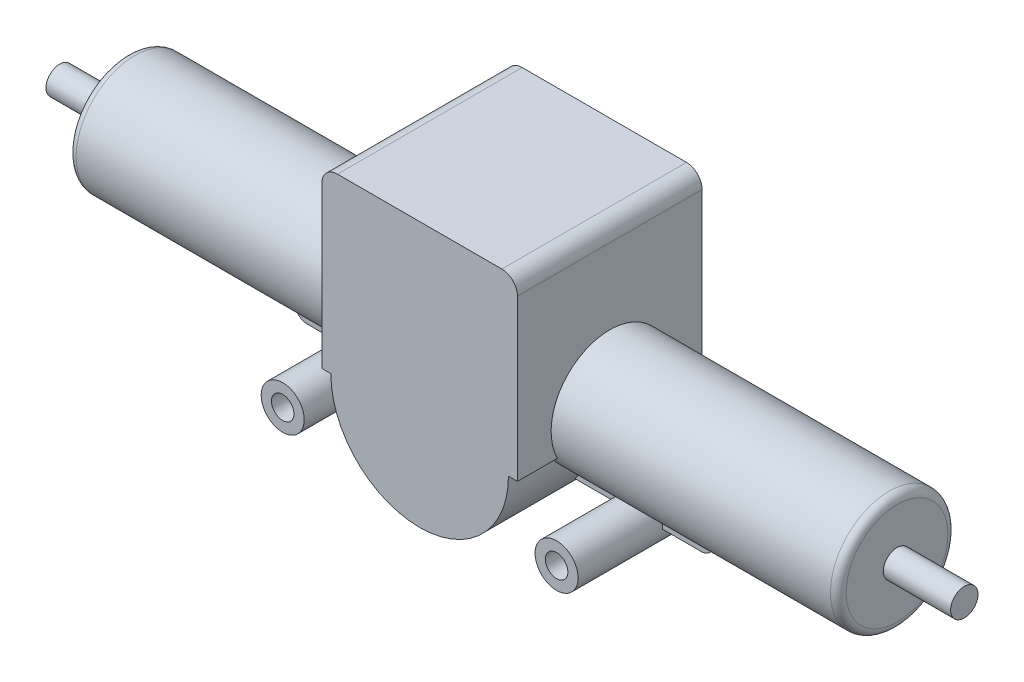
ISO-10303-21;
HEADER;
FILE_DESCRIPTION(('STEP AP214'),'2;1');
FILE_NAME('part.step','',(''),(''),'','','');
FILE_SCHEMA(('AUTOMOTIVE_DESIGN { 1 0 10303 214 1 1 1 1 }'));
ENDSEC;
DATA;
#1=APPLICATION_CONTEXT('core data for automotive mechanical design processes');
#2=APPLICATION_PROTOCOL_DEFINITION('international standard','automotive_design',2000,#1);
#3=PRODUCT_CONTEXT('',#1,'mechanical');
#4=PRODUCT('Part','Part','',(#3));
#5=PRODUCT_RELATED_PRODUCT_CATEGORY('part','',(#4));
#6=PRODUCT_DEFINITION_FORMATION('','',#4);
#7=PRODUCT_DEFINITION_CONTEXT('part definition',#1,'design');
#8=PRODUCT_DEFINITION('design','',#6,#7);
#9=PRODUCT_DEFINITION_SHAPE('','',#8);
#10=(LENGTH_UNIT() NAMED_UNIT(*) SI_UNIT(.MILLI.,.METRE.));
#11=(NAMED_UNIT(*) PLANE_ANGLE_UNIT() SI_UNIT($,.RADIAN.));
#12=(NAMED_UNIT(*) SI_UNIT($,.STERADIAN.) SOLID_ANGLE_UNIT());
#13=UNCERTAINTY_MEASURE_WITH_UNIT(LENGTH_MEASURE(1.E-05),#10,'distance_accuracy_value','');
#14=(GEOMETRIC_REPRESENTATION_CONTEXT(3) GLOBAL_UNCERTAINTY_ASSIGNED_CONTEXT((#13)) GLOBAL_UNIT_ASSIGNED_CONTEXT((#10,
#11,#12)) REPRESENTATION_CONTEXT('',''));
#15=CARTESIAN_POINT('',(0.,0.,0.));
#16=DIRECTION('',(0.,0.,1.));
#17=DIRECTION('',(1.,0.,0.));
#18=AXIS2_PLACEMENT_3D('',#15,#16,#17);
#19=CARTESIAN_POINT('',(-32.004,-11.049,1.27));
#20=DIRECTION('',(0.,0.,1.));
#21=DIRECTION('',(1.,0.,0.));
#22=AXIS2_PLACEMENT_3D('',#19,#20,#21);
#23=PLANE('',#22);
#24=DIRECTION('',(1.,0.,0.));
#25=VECTOR('',#24,1.);
#26=CARTESIAN_POINT('',(-18.7325,-12.954,1.27));
#27=LINE('',#26,#25);
#28=CARTESIAN_POINT('',(11.5187208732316,-12.954,1.27));
#29=VERTEX_POINT('',#28);
#30=CARTESIAN_POINT('',(18.7325,-12.954,1.27));
#31=VERTEX_POINT('',#30);
#32=EDGE_CURVE('E255',#29,#31,#27,.T.);
#33=ORIENTED_EDGE('',*,*,#32,.T.);
#34=CARTESIAN_POINT('',(22.225,-12.954,1.27));
#35=DIRECTION('',(0.,0.,1.));
#36=DIRECTION('',(1.,0.,0.));
#37=AXIS2_PLACEMENT_3D('',#34,#35,#36);
#38=CIRCLE('',#37,3.4925);
#39=CARTESIAN_POINT('',(25.7175,-12.954,1.27));
#40=VERTEX_POINT('',#39);
#41=EDGE_CURVE('E247',#40,#31,#38,.T.);
#42=ORIENTED_EDGE('',*,*,#41,.F.);
#43=DIRECTION('',(1.,0.,0.));
#44=VECTOR('',#43,1.);
#45=CARTESIAN_POINT('',(25.7175,-12.954,1.27));
#46=LINE('',#45,#44);
#47=CARTESIAN_POINT('',(32.004,-12.954,1.27));
#48=VERTEX_POINT('',#47);
#49=EDGE_CURVE('E227',#40,#48,#46,.T.);
#50=ORIENTED_EDGE('',*,*,#49,.T.);
#51=CARTESIAN_POINT('',(32.004,-11.049,1.27));
#52=DIRECTION('',(0.,0.,1.));
#53=DIRECTION('',(1.,0.,0.));
#54=AXIS2_PLACEMENT_3D('',#51,#52,#53);
#55=CIRCLE('',#54,1.905);
#56=CARTESIAN_POINT('',(33.909,-11.049,1.27));
#57=VERTEX_POINT('',#56);
#58=EDGE_CURVE('E239',#48,#57,#55,.T.);
#59=ORIENTED_EDGE('',*,*,#58,.T.);
#60=DIRECTION('',(0.,-1.,0.));
#61=VECTOR('',#60,1.);
#62=CARTESIAN_POINT('',(33.909,-7.11974188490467,1.27));
#63=LINE('',#62,#61);
#64=CARTESIAN_POINT('',(33.909,-9.43995365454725,1.27));
#65=VERTEX_POINT('',#64);
#66=EDGE_CURVE('E303',#65,#57,#63,.T.);
#67=ORIENTED_EDGE('',*,*,#66,.F.);
#68=DIRECTION('',(-1.,0.,0.));
#69=VECTOR('',#68,1.);
#70=CARTESIAN_POINT('',(62.484,-9.43995365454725,1.27));
#71=LINE('',#70,#69);
#72=CARTESIAN_POINT('',(13.4624208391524,-9.43995365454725,1.27));
#73=VERTEX_POINT('',#72);
#74=EDGE_CURVE('E371',#73,#65,#71,.F.);
#75=ORIENTED_EDGE('',*,*,#74,.F.);
#76=CARTESIAN_POINT('',(0.,-4.28815441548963,1.27));
#77=DIRECTION('',(0.,0.,1.));
#78=DIRECTION('',(1.,0.,0.));
#79=AXIS2_PLACEMENT_3D('',#76,#77,#78);
#80=CIRCLE('',#79,14.4145);
#81=EDGE_CURVE('E372',#29,#73,#80,.T.);
#82=ORIENTED_EDGE('',*,*,#81,.F.);
#83=EDGE_LOOP('',(#33,#42,#50,#59,#67,#75,#82));
#84=FACE_BOUND('',#83,.T.);
#85=ADVANCED_FACE('F54',(#84),#23,.T.);
#86=DIRECTION('',(1.,0.,0.));
#87=VECTOR('',#86,1.);
#88=CARTESIAN_POINT('',(-32.004,-12.954,1.27));
#89=LINE('',#88,#87);
#90=CARTESIAN_POINT('',(-32.004,-12.954,1.27));
#91=VERTEX_POINT('',#90);
#92=CARTESIAN_POINT('',(-25.7175,-12.954,1.27));
#93=VERTEX_POINT('',#92);
#94=EDGE_CURVE('E293',#91,#93,#89,.T.);
#95=ORIENTED_EDGE('',*,*,#94,.T.);
#96=CARTESIAN_POINT('',(-22.225,-12.954,1.27));
#97=DIRECTION('',(0.,0.,1.));
#98=DIRECTION('',(1.,0.,0.));
#99=AXIS2_PLACEMENT_3D('',#96,#97,#98);
#100=CIRCLE('',#99,3.4925);
#101=CARTESIAN_POINT('',(-18.7325,-12.954,1.27));
#102=VERTEX_POINT('',#101);
#103=EDGE_CURVE('E270',#102,#93,#100,.T.);
#104=ORIENTED_EDGE('',*,*,#103,.F.);
#105=CARTESIAN_POINT('',(-11.5187208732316,-12.954,1.27));
#106=VERTEX_POINT('',#105);
#107=EDGE_CURVE('E240',#102,#106,#27,.T.);
#108=ORIENTED_EDGE('',*,*,#107,.T.);
#109=CARTESIAN_POINT('',(-13.4624208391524,-9.43995365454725,1.27));
#110=VERTEX_POINT('',#109);
#111=EDGE_CURVE('E70',#110,#106,#80,.T.);
#112=ORIENTED_EDGE('',*,*,#111,.F.);
#113=DIRECTION('',(-1.,0.,0.));
#114=VECTOR('',#113,1.);
#115=CARTESIAN_POINT('',(62.484,-9.43995365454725,1.27));
#116=LINE('',#115,#114);
#117=CARTESIAN_POINT('',(-33.909,-9.43995365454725,1.27));
#118=VERTEX_POINT('',#117);
#119=EDGE_CURVE('E532',#118,#110,#116,.F.);
#120=ORIENTED_EDGE('',*,*,#119,.F.);
#121=DIRECTION('',(0.,-1.,0.));
#122=VECTOR('',#121,1.);
#123=CARTESIAN_POINT('',(-33.909,-7.11974188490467,1.27));
#124=LINE('',#123,#122);
#125=CARTESIAN_POINT('',(-33.909,-11.049,1.27));
#126=VERTEX_POINT('',#125);
#127=EDGE_CURVE('E306',#118,#126,#124,.T.);
#128=ORIENTED_EDGE('',*,*,#127,.T.);
#129=CARTESIAN_POINT('',(-32.004,-11.049,1.27));
#130=DIRECTION('',(0.,0.,1.));
#131=DIRECTION('',(1.,0.,0.));
#132=AXIS2_PLACEMENT_3D('',#129,#130,#131);
#133=CIRCLE('',#132,1.905);
#134=EDGE_CURVE('E289',#126,#91,#133,.T.);
#135=ORIENTED_EDGE('',*,*,#134,.T.);
#136=EDGE_LOOP('',(#95,#104,#108,#112,#120,#128,#135));
#137=FACE_BOUND('',#136,.T.);
#138=ADVANCED_FACE('F439',(#137),#23,.T.);
#139=CARTESIAN_POINT('',(-15.875,-4.28815441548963,14.986));
#140=DIRECTION('',(0.,1.,0.));
#141=DIRECTION('',(0.,0.,1.));
#142=AXIS2_PLACEMENT_3D('',#139,#140,#141);
#143=PLANE('',#142);
#144=DIRECTION('',(-1.,0.,0.));
#145=VECTOR('',#144,1.);
#146=CARTESIAN_POINT('',(62.484,-4.28815441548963,-8.50513707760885));
#147=LINE('',#146,#145);
#148=CARTESIAN_POINT('',(-15.875,-4.28815441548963,-8.50513707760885));
#149=VERTEX_POINT('',#148);
#150=CARTESIAN_POINT('',(-14.4145,-4.28815441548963,-8.50513707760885));
#151=VERTEX_POINT('',#150);
#152=EDGE_CURVE('E561',#149,#151,#147,.F.);
#153=ORIENTED_EDGE('',*,*,#152,.F.);
#154=DIRECTION('',(0.,0.,-1.));
#155=VECTOR('',#154,1.);
#156=CARTESIAN_POINT('',(-15.875,-4.28815441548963,14.986));
#157=LINE('',#156,#155);
#158=CARTESIAN_POINT('',(-15.875,-4.28815441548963,-14.986));
#159=VERTEX_POINT('',#158);
#160=EDGE_CURVE('E644',#149,#159,#157,.T.);
#161=ORIENTED_EDGE('',*,*,#160,.T.);
#162=DIRECTION('',(1.,0.,0.));
#163=VECTOR('',#162,1.);
#164=CARTESIAN_POINT('',(-15.875,-4.28815441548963,-14.986));
#165=LINE('',#164,#163);
#166=CARTESIAN_POINT('',(-14.4145,-4.28815441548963,-14.986));
#167=VERTEX_POINT('',#166);
#168=EDGE_CURVE('E564',#159,#167,#165,.T.);
#169=ORIENTED_EDGE('',*,*,#168,.T.);
#170=DIRECTION('',(0.,0.,-1.));
#171=VECTOR('',#170,1.);
#172=CARTESIAN_POINT('',(-14.4145,-4.28815441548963,14.986));
#173=LINE('',#172,#171);
#174=EDGE_CURVE('E554',#151,#167,#173,.T.);
#175=ORIENTED_EDGE('',*,*,#174,.F.);
#176=EDGE_LOOP('',(#153,#161,#169,#175));
#177=FACE_BOUND('',#176,.T.);
#178=ADVANCED_FACE('F445',(#177),#143,.F.);
#179=DIRECTION('',(-1.,0.,0.));
#180=VECTOR('',#179,1.);
#181=CARTESIAN_POINT('',(62.484,-4.28815441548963,8.50513707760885));
#182=LINE('',#181,#180);
#183=CARTESIAN_POINT('',(-14.4145,-4.28815441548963,8.50513707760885));
#184=VERTEX_POINT('',#183);
#185=CARTESIAN_POINT('',(-15.875,-4.28815441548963,8.50513707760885));
#186=VERTEX_POINT('',#185);
#187=EDGE_CURVE('E559',#184,#186,#182,.T.);
#188=ORIENTED_EDGE('',*,*,#187,.F.);
#189=CARTESIAN_POINT('',(-14.4145,-4.28815441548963,14.986));
#190=VERTEX_POINT('',#189);
#191=EDGE_CURVE('E567',#190,#184,#173,.T.);
#192=ORIENTED_EDGE('',*,*,#191,.F.);
#193=DIRECTION('',(1.,0.,0.));
#194=VECTOR('',#193,1.);
#195=CARTESIAN_POINT('',(-15.875,-4.28815441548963,14.986));
#196=LINE('',#195,#194);
#197=CARTESIAN_POINT('',(-15.875,-4.28815441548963,14.986));
#198=VERTEX_POINT('',#197);
#199=EDGE_CURVE('E594',#198,#190,#196,.T.);
#200=ORIENTED_EDGE('',*,*,#199,.F.);
#201=EDGE_CURVE('E645',#198,#186,#157,.T.);
#202=ORIENTED_EDGE('',*,*,#201,.T.);
#203=EDGE_LOOP('',(#188,#192,#200,#202));
#204=FACE_BOUND('',#203,.T.);
#205=ADVANCED_FACE('F436',(#204),#143,.F.);
#206=CARTESIAN_POINT('',(0.,-4.28815441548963,14.986));
#207=DIRECTION('',(0.,0.,-1.));
#208=DIRECTION('',(-1.,0.,0.));
#209=AXIS2_PLACEMENT_3D('',#206,#207,#208);
#210=CYLINDRICAL_SURFACE('',#209,14.4145);
#211=CARTESIAN_POINT('',(-14.4145,-4.28815441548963,8.50513707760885));
#212=CARTESIAN_POINT('',(-14.4144990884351,-4.08154157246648,8.60930671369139));
#213=CARTESIAN_POINT('',(-14.410050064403,-3.87110408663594,8.70595394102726));
#214=CARTESIAN_POINT('',(-14.3913510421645,-3.44404047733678,8.88356452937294));
#215=CARTESIAN_POINT('',(-14.3770972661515,-3.22741199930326,8.9645218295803));
#216=CARTESIAN_POINT('',(-14.3380613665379,-2.78942310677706,9.11032797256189));
#217=CARTESIAN_POINT('',(-14.3132664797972,-2.56805726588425,9.17515713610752));
#218=CARTESIAN_POINT('',(-14.2526811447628,-2.12265285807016,9.28831324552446));
#219=CARTESIAN_POINT('',(-14.2168918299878,-1.89861456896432,9.33664189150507));
#220=CARTESIAN_POINT('',(-14.134141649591,-1.44987046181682,9.41676174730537));
#221=CARTESIAN_POINT('',(-14.0871911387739,-1.22516545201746,9.4485681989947));
#222=CARTESIAN_POINT('',(-13.9821401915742,-0.776656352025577,9.49596160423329));
#223=CARTESIAN_POINT('',(-13.924039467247,-0.552852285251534,9.51154813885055));
#224=CARTESIAN_POINT('',(-13.7969696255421,-0.107845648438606,9.52699114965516));
#225=CARTESIAN_POINT('',(-13.7280018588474,0.113357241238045,9.52684957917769));
#226=CARTESIAN_POINT('',(-13.5796592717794,0.551702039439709,9.5115378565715));
#227=CARTESIAN_POINT('',(-13.5002842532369,0.768843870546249,9.49636741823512));
#228=CARTESIAN_POINT('',(-13.3305560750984,1.20080666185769,9.45153447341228));
#229=CARTESIAN_POINT('',(-13.2400642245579,1.4155520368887,9.4216711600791));
#230=CARTESIAN_POINT('',(-13.0497570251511,1.83846202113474,9.34835527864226));
#231=CARTESIAN_POINT('',(-12.9499418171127,2.0466267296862,9.30490291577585));
#232=CARTESIAN_POINT('',(-12.7417683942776,2.45556845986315,9.20543847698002));
#233=CARTESIAN_POINT('',(-12.6334090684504,2.65634451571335,9.14942476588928));
#234=CARTESIAN_POINT('',(-12.4089604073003,3.04988746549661,9.02587211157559));
#235=CARTESIAN_POINT('',(-12.2928694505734,3.24265266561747,8.95833074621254));
#236=CARTESIAN_POINT('',(-11.9968170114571,3.70951668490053,8.77804690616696));
#237=CARTESIAN_POINT('',(-11.8127598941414,3.97864708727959,8.65909331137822));
#238=CARTESIAN_POINT('',(-11.4319776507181,4.49771007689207,8.40120766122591));
#239=CARTESIAN_POINT('',(-11.2352476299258,4.74763516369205,8.26226786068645));
#240=CARTESIAN_POINT('',(-10.8308339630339,5.22866457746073,7.96659359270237));
#241=CARTESIAN_POINT('',(-10.6231214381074,5.45971475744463,7.80981081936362));
#242=CARTESIAN_POINT('',(-10.1993295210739,5.90230074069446,7.4809414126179));
#243=CARTESIAN_POINT('',(-9.98325053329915,6.11383748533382,7.30885551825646));
#244=CARTESIAN_POINT('',(-9.47418970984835,6.5825686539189,6.89365455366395));
#245=CARTESIAN_POINT('',(-9.17877624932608,6.83263799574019,6.64546412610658));
#246=CARTESIAN_POINT('',(-8.58062678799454,7.30040905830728,6.12792544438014));
#247=CARTESIAN_POINT('',(-8.27788664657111,7.51809195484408,5.85856502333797));
#248=CARTESIAN_POINT('',(-7.82223825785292,7.82066866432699,5.43987905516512));
#249=CARTESIAN_POINT('',(-7.67024016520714,7.9174579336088,5.29801391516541));
#250=CARTESIAN_POINT('',(-7.36630321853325,8.10325752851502,5.00922509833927));
#251=CARTESIAN_POINT('',(-7.21436436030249,8.19226857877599,4.86230189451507));
#252=CARTESIAN_POINT('',(-6.91146986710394,8.36251982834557,4.56327399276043));
#253=CARTESIAN_POINT('',(-6.76051364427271,8.44376516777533,4.4111728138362));
#254=CARTESIAN_POINT('',(-6.46056002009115,8.59856086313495,4.1012665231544));
#255=CARTESIAN_POINT('',(-6.31156227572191,8.67211258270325,3.94346242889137));
#256=CARTESIAN_POINT('',(-6.06056616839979,8.79085643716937,3.66902195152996));
#257=CARTESIAN_POINT('',(-5.95770392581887,8.83800115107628,3.55401765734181));
#258=CARTESIAN_POINT('',(-5.75438838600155,8.928395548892,3.32040219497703));
#259=CARTESIAN_POINT('',(-5.65393497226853,8.97164542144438,3.20179120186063));
#260=CARTESIAN_POINT('',(-5.45628589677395,9.05419290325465,2.9603231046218));
#261=CARTESIAN_POINT('',(-5.35909350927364,9.09348661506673,2.83746197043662));
#262=CARTESIAN_POINT('',(-5.16940208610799,9.16790232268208,2.58694344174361));
#263=CARTESIAN_POINT('',(-5.07690245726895,9.20302484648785,2.45928665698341));
#264=CARTESIAN_POINT('',(-4.91589059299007,9.26240580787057,2.22377529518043));
#265=CARTESIAN_POINT('',(-4.84622087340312,9.28744656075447,2.11692027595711));
#266=CARTESIAN_POINT('',(-4.71254575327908,9.33442876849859,1.89908012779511));
#267=CARTESIAN_POINT('',(-4.64854211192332,9.35636926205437,1.78809373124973));
#268=CARTESIAN_POINT('',(-4.46801434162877,9.41697289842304,1.44874654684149));
#269=CARTESIAN_POINT('',(-4.36233184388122,9.45064908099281,1.21311047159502));
#270=CARTESIAN_POINT('',(-4.23092309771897,9.49154463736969,0.812724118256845));
#271=CARTESIAN_POINT('',(-4.19009022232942,9.50393569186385,0.653572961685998));
#272=CARTESIAN_POINT('',(-4.13473913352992,9.520633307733,0.330436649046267));
#273=CARTESIAN_POINT('',(-4.12016442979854,9.52495722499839,0.166462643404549));
#274=CARTESIAN_POINT('',(-4.11987989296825,9.52504224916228,-0.161965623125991));
#275=CARTESIAN_POINT('',(-4.13424937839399,9.52077982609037,-0.326419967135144));
#276=CARTESIAN_POINT('',(-4.18936355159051,9.50415603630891,-0.650470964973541));
#277=CARTESIAN_POINT('',(-4.23015759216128,9.49177951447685,-0.810057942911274));
#278=CARTESIAN_POINT('',(-4.35997859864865,9.45138635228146,-1.20645321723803));
#279=CARTESIAN_POINT('',(-4.46317273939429,9.41852364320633,-1.4380200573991));
#280=CARTESIAN_POINT('',(-4.63950565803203,9.3594374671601,-1.77184465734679));
#281=CARTESIAN_POINT('',(-4.70206071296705,9.33804293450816,-1.88112630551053));
#282=CARTESIAN_POINT('',(-4.83274196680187,9.29224263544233,-2.09567638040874));
#283=CARTESIAN_POINT('',(-4.90086695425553,9.26783752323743,-2.20094567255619));
#284=CARTESIAN_POINT('',(-5.07117033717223,9.20526618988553,-2.45190467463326));
#285=CARTESIAN_POINT('',(-5.17551244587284,9.16566081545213,-2.59575075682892));
#286=CARTESIAN_POINT('',(-5.39003652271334,9.08116246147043,-2.87745126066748));
#287=CARTESIAN_POINT('',(-5.50022092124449,9.03626727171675,-3.01530314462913));
#288=CARTESIAN_POINT('',(-5.72475574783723,8.94135279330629,-3.28609962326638));
#289=CARTESIAN_POINT('',(-5.83911213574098,8.8913259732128,-3.41903660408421));
#290=CARTESIAN_POINT('',(-6.07058876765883,8.78632233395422,-3.68048805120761));
#291=CARTESIAN_POINT('',(-6.18770942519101,8.73134477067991,-3.80900184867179));
#292=CARTESIAN_POINT('',(-6.54241764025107,8.55877981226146,-4.18935668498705));
#293=CARTESIAN_POINT('',(-6.78276236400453,8.43380544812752,-4.4353191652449));
#294=CARTESIAN_POINT('',(-7.2655530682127,8.16439811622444,-4.9135919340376));
#295=CARTESIAN_POINT('',(-7.50799715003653,8.01998129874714,-5.14591332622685));
#296=CARTESIAN_POINT('',(-8.00486876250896,7.7031432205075,-5.6098322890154));
#297=CARTESIAN_POINT('',(-8.2592531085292,7.52964592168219,-5.8407439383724));
#298=CARTESIAN_POINT('',(-8.76433759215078,7.16008489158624,-6.28832480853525));
#299=CARTESIAN_POINT('',(-9.01503663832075,6.96401462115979,-6.50498987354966));
#300=CARTESIAN_POINT('',(-9.5095570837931,6.54928199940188,-6.92234474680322));
#301=CARTESIAN_POINT('',(-9.75339391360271,6.33067653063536,-7.123072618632));
#302=CARTESIAN_POINT('',(-10.2323128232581,5.86999149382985,-7.50724521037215));
#303=CARTESIAN_POINT('',(-10.4673974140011,5.62791873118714,-7.69069491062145));
#304=CARTESIAN_POINT('',(-10.8795218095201,5.17166267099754,-8.00247129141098));
#305=CARTESIAN_POINT('',(-11.0586397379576,4.96182603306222,-8.13441916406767));
#306=CARTESIAN_POINT('',(-11.4082474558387,4.52703108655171,-8.38417915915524));
#307=CARTESIAN_POINT('',(-11.5787374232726,4.30207309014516,-8.50199157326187));
#308=CARTESIAN_POINT('',(-11.9094193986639,3.83741091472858,-8.72157658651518));
#309=CARTESIAN_POINT('',(-12.0696167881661,3.59771457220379,-8.82335760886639));
#310=CARTESIAN_POINT('',(-12.3781008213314,3.10407676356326,-9.00887424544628));
#311=CARTESIAN_POINT('',(-12.5263896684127,2.85013794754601,-9.09261320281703));
#312=CARTESIAN_POINT('',(-12.7843571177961,2.37500443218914,-9.2268479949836));
#313=CARTESIAN_POINT('',(-12.8962356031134,2.15592162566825,-9.28060130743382));
#314=CARTESIAN_POINT('',(-13.1097028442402,1.7097310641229,-9.3730639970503));
#315=CARTESIAN_POINT('',(-13.2112936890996,1.48262495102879,-9.41177643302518));
#316=CARTESIAN_POINT('',(-13.4032067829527,1.02166212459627,-9.47290112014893));
#317=CARTESIAN_POINT('',(-13.4935343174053,0.787808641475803,-9.49532104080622));
#318=CARTESIAN_POINT('',(-13.6621361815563,0.314766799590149,-9.52274477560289));
#319=CARTESIAN_POINT('',(-13.7404104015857,0.0755783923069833,-9.52774843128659));
#320=CARTESIAN_POINT('',(-13.8846637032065,-0.40770601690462,-9.51935615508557));
#321=CARTESIAN_POINT('',(-13.9505682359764,-0.65182253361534,-9.5058524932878));
#322=CARTESIAN_POINT('',(-14.0691002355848,-1.14146191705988,-9.45955366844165));
#323=CARTESIAN_POINT('',(-14.1217276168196,-1.38698479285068,-9.42675838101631));
#324=CARTESIAN_POINT('',(-14.2136099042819,-1.87708453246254,-9.34152207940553));
#325=CARTESIAN_POINT('',(-14.2528668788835,-2.12166153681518,-9.28908410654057));
#326=CARTESIAN_POINT('',(-14.3182889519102,-2.60753207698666,-9.1645666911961));
#327=CARTESIAN_POINT('',(-14.3444549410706,-2.84882583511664,-9.09248858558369));
#328=CARTESIAN_POINT('',(-14.3824383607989,-3.30315775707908,-8.93682551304));
#329=CARTESIAN_POINT('',(-14.3953826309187,-3.5167027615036,-8.85498386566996));
#330=CARTESIAN_POINT('',(-14.4117798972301,-3.93772012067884,-8.67596247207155));
#331=CARTESIAN_POINT('',(-14.4152297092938,-4.1451904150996,-8.57877759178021));
#332=CARTESIAN_POINT('',(-14.4135148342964,-4.55248188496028,-8.36976206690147));
#333=CARTESIAN_POINT('',(-14.4083528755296,-4.75230546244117,-8.25793607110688));
#334=CARTESIAN_POINT('',(-14.3904484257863,-5.14320184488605,-8.02031429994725));
#335=CARTESIAN_POINT('',(-14.3777029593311,-5.33427118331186,-7.89451305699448));
#336=CARTESIAN_POINT('',(-14.3451851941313,-5.71326879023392,-7.62497241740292));
#337=CARTESIAN_POINT('',(-14.3251745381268,-5.90083105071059,-7.48074752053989));
#338=CARTESIAN_POINT('',(-14.2795626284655,-6.26438466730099,-7.17906238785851));
#339=CARTESIAN_POINT('',(-14.2539589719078,-6.44037100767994,-7.02159648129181));
#340=CARTESIAN_POINT('',(-14.1985479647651,-6.77986827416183,-6.69437134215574));
#341=CARTESIAN_POINT('',(-14.16873971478,-6.9433765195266,-6.52460948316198));
#342=CARTESIAN_POINT('',(-14.1063289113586,-7.2571420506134,-6.17372790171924));
#343=CARTESIAN_POINT('',(-14.0737261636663,-7.40739841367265,-5.99260738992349));
#344=CARTESIAN_POINT('',(-14.0035486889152,-7.70940953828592,-5.59985805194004));
#345=CARTESIAN_POINT('',(-13.9658163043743,-7.85958799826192,-5.38704292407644));
#346=CARTESIAN_POINT('',(-13.8905407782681,-8.14198925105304,-4.94988241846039));
#347=CARTESIAN_POINT('',(-13.8529975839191,-8.27421735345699,-4.72554047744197));
#348=CARTESIAN_POINT('',(-13.77988628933,-8.52005776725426,-4.26639052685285));
#349=CARTESIAN_POINT('',(-13.7443193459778,-8.63365924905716,-4.03157652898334));
#350=CARTESIAN_POINT('',(-13.6769215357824,-8.84134552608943,-3.55305979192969));
#351=CARTESIAN_POINT('',(-13.6450891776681,-8.93543812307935,-3.30936065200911));
#352=CARTESIAN_POINT('',(-13.5857284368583,-9.10627207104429,-2.80613360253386));
#353=CARTESIAN_POINT('',(-13.5583810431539,-9.18232258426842,-2.54634901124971));
#354=CARTESIAN_POINT('',(-13.5108147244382,-9.31214542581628,-2.02061420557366));
#355=CARTESIAN_POINT('',(-13.4905959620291,-9.36591724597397,-1.75466385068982));
#356=CARTESIAN_POINT('',(-13.4584210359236,-9.45059294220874,-1.21879278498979));
#357=CARTESIAN_POINT('',(-13.4464603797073,-9.48150925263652,-0.948874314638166));
#358=CARTESIAN_POINT('',(-13.4314663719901,-9.52016741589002,-0.407143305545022));
#359=CARTESIAN_POINT('',(-13.4284324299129,-9.52791080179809,-0.135330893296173));
#360=CARTESIAN_POINT('',(-13.4313653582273,-9.52038475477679,0.390730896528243));
#361=CARTESIAN_POINT('',(-13.4367757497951,-9.50653815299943,0.645005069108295));
#362=CARTESIAN_POINT('',(-13.4553033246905,-9.45857831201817,1.15134051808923));
#363=CARTESIAN_POINT('',(-13.4684202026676,-9.4244658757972,1.40340188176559));
#364=CARTESIAN_POINT('',(-13.5017107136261,-9.33630559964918,1.90355346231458));
#365=CARTESIAN_POINT('',(-13.5218849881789,-9.28225594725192,2.15164331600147));
#366=CARTESIAN_POINT('',(-13.5683104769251,-9.15470958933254,2.6421862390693));
#367=CARTESIAN_POINT('',(-13.5945618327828,-9.08121243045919,2.88463917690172));
#368=CARTESIAN_POINT('',(-13.6518679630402,-8.91546286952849,3.36213424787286));
#369=CARTESIAN_POINT('',(-13.6829171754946,-8.82323214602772,3.59718458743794));
#370=CARTESIAN_POINT('',(-13.7484246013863,-8.62058644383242,4.05890403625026));
#371=CARTESIAN_POINT('',(-13.7828839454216,-8.51016542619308,4.28557033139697));
#372=CARTESIAN_POINT('',(-13.8536696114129,-8.27176029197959,4.72938775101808));
#373=CARTESIAN_POINT('',(-13.8899973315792,-8.14376289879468,4.94653151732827));
#374=CARTESIAN_POINT('',(-13.9628470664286,-7.87097990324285,5.36998499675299));
#375=CARTESIAN_POINT('',(-13.9993690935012,-7.72619321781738,5.57629400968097));
#376=CARTESIAN_POINT('',(-14.0733288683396,-7.41022098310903,5.99054461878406));
#377=CARTESIAN_POINT('',(-14.1106609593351,-7.23791139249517,6.19764946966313));
#378=CARTESIAN_POINT('',(-14.1814833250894,-6.87606958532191,6.59680405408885));
#379=CARTESIAN_POINT('',(-14.2149750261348,-6.68654380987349,6.7888593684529));
#380=CARTESIAN_POINT('',(-14.2759584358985,-6.29180451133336,7.15621055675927));
#381=CARTESIAN_POINT('',(-14.3034636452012,-6.08662772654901,7.33154362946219));
#382=CARTESIAN_POINT('',(-14.3505041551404,-5.66164742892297,7.66447353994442));
#383=CARTESIAN_POINT('',(-14.3700444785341,-5.44185323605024,7.82208150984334));
#384=CARTESIAN_POINT('',(-14.3942575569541,-5.06632245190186,8.06782719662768));
#385=CARTESIAN_POINT('',(-14.4017272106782,-4.91425733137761,8.16134638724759));
#386=CARTESIAN_POINT('',(-14.4118494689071,-4.60494066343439,8.33978598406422));
#387=CARTESIAN_POINT('',(-14.4145007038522,-4.44768765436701,8.42470393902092));
#388=CARTESIAN_POINT('',(-14.4145,-4.28815441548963,8.50513707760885));
#389=B_SPLINE_CURVE_WITH_KNOTS('',3,(#211,#212,#213,#214,#215,#216,#217,#218,#219,#220,#221,
#222,#223,#224,#225,#226,#227,#228,#229,#230,#231,#232,#233,#234,#235,#236,#237,#238,#239,#240,
#241,#242,#243,#244,#245,#246,#247,#248,#249,#250,#251,#252,#253,#254,#255,#256,#257,#258,#259,
#260,#261,#262,#263,#264,#265,#266,#267,#268,#269,#270,#271,#272,#273,#274,#275,#276,#277,#278,
#279,#280,#281,#282,#283,#284,#285,#286,#287,#288,#289,#290,#291,#292,#293,#294,#295,#296,#297,
#298,#299,#300,#301,#302,#303,#304,#305,#306,#307,#308,#309,#310,#311,#312,#313,#314,#315,#316,
#317,#318,#319,#320,#321,#322,#323,#324,#325,#326,#327,#328,#329,#330,#331,#332,#333,#334,#335,
#336,#337,#338,#339,#340,#341,#342,#343,#344,#345,#346,#347,#348,#349,#350,#351,#352,#353,#354,
#355,#356,#357,#358,#359,#360,#361,#362,#363,#364,#365,#366,#367,#368,#369,#370,#371,#372,#373,
#374,#375,#376,#377,#378,#379,#380,#381,#382,#383,#384,#385,#386,#387,#388),.UNSPECIFIED.,.T.,
.F.,(4,2,2,2,2,2,2,2,2,2,2,2,2,2,2,2,2,2,2,2,2,2,2,2,2,2,2,2,2,2,2,2,2,2,2,2,2,2,2,2,2,2,2,2,2,
2,2,2,2,2,2,2,2,2,2,2,2,2,2,2,2,2,2,2,2,2,2,2,2,2,2,2,2,2,2,2,2,2,2,2,2,2,2,2,2,2,2,2,4),(0.,
0.694005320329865,1.38827819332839,2.08339409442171,2.77843835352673,3.47284028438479,
4.16726014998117,4.86159377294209,5.55594061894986,6.26005231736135,6.96415338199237,
7.66834615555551,8.37268707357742,9.41234424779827,10.4524054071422,11.4953524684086,
12.5382491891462,13.9157333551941,15.2940150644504,15.9818866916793,16.6696941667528,
17.3570431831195,18.0442701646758,18.5281889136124,19.0120842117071,19.4964516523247,
19.9807577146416,20.370513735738,20.7603903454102,21.5368059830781,22.0292182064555,
22.5205698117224,23.0132697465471,23.5068925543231,24.2691604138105,24.6522517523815,
25.0352599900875,25.5811094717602,26.1271878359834,26.6740794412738,27.2210533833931,
28.3178183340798,29.4136777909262,30.5673998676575,31.7214570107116,32.8726693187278,
34.0235487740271,34.9402668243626,35.8569659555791,36.7731818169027,37.6892277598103,
38.4439066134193,39.198431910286,39.9526017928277,40.7067785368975,41.4653639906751,
42.2239543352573,42.9824272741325,43.740848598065,44.4272300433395,45.1138416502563,
45.8002357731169,46.4868993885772,47.1984976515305,47.910402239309,48.6224593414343,
49.3345659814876,50.1232467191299,50.9116936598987,51.7005973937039,52.4891850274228,
53.3043227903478,54.1194791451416,54.9341916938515,55.7488503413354,56.5120465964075,
57.2752126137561,58.0384480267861,58.8017012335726,59.5640761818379,60.3267047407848,
61.0899125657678,61.8531696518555,62.6681484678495,63.4828236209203,64.2956420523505,
65.1079471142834,65.6436614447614,66.1795280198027),.UNSPECIFIED.);
#390=EDGE_CURVE('E393',#110,#184,#389,.T.);
#391=ORIENTED_EDGE('',*,*,#390,.F.);
#392=ORIENTED_EDGE('',*,*,#111,.T.);
#393=DIRECTION('',(0.,0.,-1.));
#394=VECTOR('',#393,1.);
#395=CARTESIAN_POINT('',(-11.5187208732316,-12.954,14.986));
#396=LINE('',#395,#394);
#397=CARTESIAN_POINT('',(-11.5187208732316,-12.954,-1.27));
#398=VERTEX_POINT('',#397);
#399=EDGE_CURVE('E63',#398,#106,#396,.F.);
#400=ORIENTED_EDGE('',*,*,#399,.F.);
#401=CARTESIAN_POINT('',(0.,-4.28815441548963,-1.27));
#402=DIRECTION('',(0.,0.,1.));
#403=DIRECTION('',(1.,0.,0.));
#404=AXIS2_PLACEMENT_3D('',#401,#402,#403);
#405=CIRCLE('',#404,14.4145);
#406=CARTESIAN_POINT('',(-13.4624208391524,-9.43995365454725,-1.27));
#407=VERTEX_POINT('',#406);
#408=EDGE_CURVE('E361',#407,#398,#405,.T.);
#409=ORIENTED_EDGE('',*,*,#408,.F.);
#410=EDGE_CURVE('E394',#151,#407,#389,.T.);
#411=ORIENTED_EDGE('',*,*,#410,.F.);
#412=ORIENTED_EDGE('',*,*,#174,.T.);
#413=CARTESIAN_POINT('',(0.,-4.28815441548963,-14.986));
#414=DIRECTION('',(0.,0.,1.));
#415=DIRECTION('',(1.,0.,0.));
#416=AXIS2_PLACEMENT_3D('',#413,#414,#415);
#417=CIRCLE('',#416,14.4145);
#418=CARTESIAN_POINT('',(14.4145,-4.28815441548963,-14.986));
#419=VERTEX_POINT('',#418);
#420=EDGE_CURVE('E622',#167,#419,#417,.T.);
#421=ORIENTED_EDGE('',*,*,#420,.T.);
#422=DIRECTION('',(0.,0.,-1.));
#423=VECTOR('',#422,1.);
#424=CARTESIAN_POINT('',(14.4145,-4.28815441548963,14.986));
#425=LINE('',#424,#423);
#426=CARTESIAN_POINT('',(14.4145,-4.28815441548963,-8.50513707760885));
#427=VERTEX_POINT('',#426);
#428=EDGE_CURVE('E638',#427,#419,#425,.T.);
#429=ORIENTED_EDGE('',*,*,#428,.F.);
#430=CARTESIAN_POINT('',(13.7618872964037,0.,9.525));
#431=CARTESIAN_POINT('',(13.8306755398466,-0.220765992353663,9.52499847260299));
#432=CARTESIAN_POINT('',(13.894160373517,-0.44324323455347,9.51731451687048));
#433=CARTESIAN_POINT('',(14.0101343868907,-0.890029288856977,9.48597163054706));
#434=CARTESIAN_POINT('',(14.0626183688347,-1.11433891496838,9.46230517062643));
#435=CARTESIAN_POINT('',(14.1564744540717,-1.56332249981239,9.39857045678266));
#436=CARTESIAN_POINT('',(14.1978298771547,-1.78799650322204,9.35847780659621));
#437=CARTESIAN_POINT('',(14.2694035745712,-2.23552630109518,9.2617736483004));
#438=CARTESIAN_POINT('',(14.299623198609,-2.45838231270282,9.20516414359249));
#439=CARTESIAN_POINT('',(14.3492503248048,-2.90027413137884,9.07562635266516));
#440=CARTESIAN_POINT('',(14.3686687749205,-3.11931358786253,9.002714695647));
#441=CARTESIAN_POINT('',(14.3973281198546,-3.55209008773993,8.84090805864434));
#442=CARTESIAN_POINT('',(14.4065686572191,-3.7658269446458,8.75201251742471));
#443=CARTESIAN_POINT('',(14.4156742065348,-4.18633654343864,8.55883945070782));
#444=CARTESIAN_POINT('',(14.4155424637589,-4.39311167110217,8.4545672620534));
#445=CARTESIAN_POINT('',(14.4068915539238,-4.79845183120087,8.23128484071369));
#446=CARTESIAN_POINT('',(14.3983691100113,-4.9970136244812,8.11226886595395));
#447=CARTESIAN_POINT('',(14.3739013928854,-5.38697237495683,7.85880945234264));
#448=CARTESIAN_POINT('',(14.3578676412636,-5.57825371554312,7.72419692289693));
#449=CARTESIAN_POINT('',(14.3195950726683,-5.95006685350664,7.44156467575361));
#450=CARTESIAN_POINT('',(14.2973541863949,-6.13059504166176,7.29354049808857));
#451=CARTESIAN_POINT('',(14.2479789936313,-6.47996646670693,6.98498318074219));
#452=CARTESIAN_POINT('',(14.2208436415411,-6.64880719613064,6.82444737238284));
#453=CARTESIAN_POINT('',(14.1630274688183,-6.97399564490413,6.49177366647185));
#454=CARTESIAN_POINT('',(14.1323463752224,-7.13034240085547,6.31963487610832));
#455=CARTESIAN_POINT('',(14.0654136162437,-7.44578624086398,5.94574658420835));
#456=CARTESIAN_POINT('',(14.028916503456,-7.60340845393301,5.74279470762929));
#457=CARTESIAN_POINT('',(13.9550748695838,-7.9016425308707,5.3249916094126));
#458=CARTESIAN_POINT('',(13.9177305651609,-8.04225868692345,5.11014341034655));
#459=CARTESIAN_POINT('',(13.8439408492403,-8.30584796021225,4.66952473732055));
#460=CARTESIAN_POINT('',(13.8074960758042,-8.42880883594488,4.44374682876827));
#461=CARTESIAN_POINT('',(13.7372608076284,-8.65617846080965,3.98274170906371));
#462=CARTESIAN_POINT('',(13.7034693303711,-8.76059409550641,3.74751804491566));
#463=CARTESIAN_POINT('',(13.6384884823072,-8.95511362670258,3.25650762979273));
#464=CARTESIAN_POINT('',(13.6075237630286,-9.04419933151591,3.00028637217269));
#465=CARTESIAN_POINT('',(13.5519416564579,-9.20033990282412,2.48052452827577));
#466=CARTESIAN_POINT('',(13.5273244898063,-9.26739400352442,2.21698368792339));
#467=CARTESIAN_POINT('',(13.4858066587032,-9.37877016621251,1.68469054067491));
#468=CARTESIAN_POINT('',(13.4689015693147,-9.42310526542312,1.41594131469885));
#469=CARTESIAN_POINT('',(13.4437460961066,-9.48861050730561,0.875238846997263));
#470=CARTESIAN_POINT('',(13.4354950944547,-9.50978230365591,0.60328583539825));
#471=CARTESIAN_POINT('',(13.4283309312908,-9.52817525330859,0.0741485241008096));
#472=CARTESIAN_POINT('',(13.4289073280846,-9.526705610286,-0.18298426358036));
#473=CARTESIAN_POINT('',(13.4381313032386,-9.50299865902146,-0.69613769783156));
#474=CARTESIAN_POINT('',(13.4467785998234,-9.48076207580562,-0.952158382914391));
#475=CARTESIAN_POINT('',(13.4717035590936,-9.41574826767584,-1.46122033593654));
#476=CARTESIAN_POINT('',(13.4879820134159,-9.3729689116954,-1.71426129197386));
#477=CARTESIAN_POINT('',(13.5273521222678,-9.26728360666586,-2.21555881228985));
#478=CARTESIAN_POINT('',(13.5504438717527,-9.20437737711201,-2.46381530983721));
#479=CARTESIAN_POINT('',(13.6018562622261,-9.06026674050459,-2.94962121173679));
#480=CARTESIAN_POINT('',(13.6300784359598,-8.97940144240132,-3.18728192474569));
#481=CARTESIAN_POINT('',(13.6907219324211,-8.79935859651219,-3.65510007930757));
#482=CARTESIAN_POINT('',(13.7231447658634,-8.70017445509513,-3.88525478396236));
#483=CARTESIAN_POINT('',(13.7907297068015,-8.48415113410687,-4.33675555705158));
#484=CARTESIAN_POINT('',(13.8258923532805,-8.36730847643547,-4.55809987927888));
#485=CARTESIAN_POINT('',(13.897383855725,-8.1166673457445,-4.99077655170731));
#486=CARTESIAN_POINT('',(13.9337127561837,-7.98286822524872,-5.20210851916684));
#487=CARTESIAN_POINT('',(14.008319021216,-7.68950970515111,-5.62745055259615));
#488=CARTESIAN_POINT('',(14.0465638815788,-7.52882506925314,-5.84069163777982));
#489=CARTESIAN_POINT('',(14.120460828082,-7.18995557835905,-6.25310827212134));
#490=CARTESIAN_POINT('',(14.1561140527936,-7.01177849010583,-6.45228999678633));
#491=CARTESIAN_POINT('',(14.2228078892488,-6.63878205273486,-6.83547493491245));
#492=CARTESIAN_POINT('',(14.2538461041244,-6.44395413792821,-7.01947023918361));
#493=CARTESIAN_POINT('',(14.3092283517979,-6.03901805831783,-7.37073146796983));
#494=CARTESIAN_POINT('',(14.3335756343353,-5.82891737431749,-7.5380054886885));
#495=CARTESIAN_POINT('',(14.3734255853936,-5.39679257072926,-7.8530939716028));
#496=CARTESIAN_POINT('',(14.3890083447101,-5.17489740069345,-8.00107482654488));
#497=CARTESIAN_POINT('',(14.4098623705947,-4.71909368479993,-8.27809715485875));
#498=CARTESIAN_POINT('',(14.415133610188,-4.48518510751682,-8.40713857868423));
#499=CARTESIAN_POINT('',(14.4137453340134,-4.00757803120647,-8.64500129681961));
#500=CARTESIAN_POINT('',(14.4070964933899,-3.76388848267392,-8.75384058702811));
#501=CARTESIAN_POINT('',(14.3805515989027,-3.26886655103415,-8.95047687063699));
#502=CARTESIAN_POINT('',(14.3606571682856,-3.01753510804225,-9.03827644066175));
#503=CARTESIAN_POINT('',(14.3095387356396,-2.53688012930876,-9.18401111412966));
#504=CARTESIAN_POINT('',(14.2797469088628,-2.30806327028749,-9.24413088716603));
#505=CARTESIAN_POINT('',(14.2084233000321,-1.84835878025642,-9.34690608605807));
#506=CARTESIAN_POINT('',(14.1668924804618,-1.61747132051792,-9.38956294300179));
#507=CARTESIAN_POINT('',(14.0719798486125,-1.15562024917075,-9.45751808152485));
#508=CARTESIAN_POINT('',(14.0185996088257,-0.924656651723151,-9.48281866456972));
#509=CARTESIAN_POINT('',(13.9001430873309,-0.464507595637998,-9.51646349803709));
#510=CARTESIAN_POINT('',(13.8350666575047,-0.235322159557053,-9.52480753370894));
#511=CARTESIAN_POINT('',(13.6963989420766,0.210605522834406,-9.5251784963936));
#512=CARTESIAN_POINT('',(13.6232416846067,0.427483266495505,-9.51783251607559));
#513=CARTESIAN_POINT('',(13.4670352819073,0.856640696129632,-9.48883804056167));
#514=CARTESIAN_POINT('',(13.3839867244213,1.06892065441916,-9.46719039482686));
#515=CARTESIAN_POINT('',(13.2086168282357,1.48781490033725,-9.41045785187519));
#516=CARTESIAN_POINT('',(13.116293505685,1.69442796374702,-9.37537007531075));
#517=CARTESIAN_POINT('',(12.9230950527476,2.10106519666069,-9.29269708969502));
#518=CARTESIAN_POINT('',(12.8222182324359,2.30108805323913,-9.24510940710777));
#519=CARTESIAN_POINT('',(12.573089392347,2.767991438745,-9.11824604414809));
#520=CARTESIAN_POINT('',(12.4213281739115,3.03160809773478,-9.03378959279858));
#521=CARTESIAN_POINT('',(12.1049459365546,3.54375358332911,-8.84544749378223));
#522=CARTESIAN_POINT('',(11.9403210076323,3.79227778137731,-8.74155592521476));
#523=CARTESIAN_POINT('',(11.5998178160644,4.27392237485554,-8.51645425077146));
#524=CARTESIAN_POINT('',(11.4239210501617,4.5070160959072,-8.39521524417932));
#525=CARTESIAN_POINT('',(11.0628836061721,4.95704251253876,-8.13760347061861));
#526=CARTESIAN_POINT('',(10.877742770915,5.1739749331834,-8.00123044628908));
#527=CARTESIAN_POINT('',(10.4346586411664,5.66368511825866,-7.66578095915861));
#528=CARTESIAN_POINT('',(10.1736072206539,5.92995641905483,-7.46128780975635));
#529=CARTESIAN_POINT('',(9.64112687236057,6.43382915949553,-7.03144506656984));
#530=CARTESIAN_POINT('',(9.36969349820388,6.67141812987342,-6.80608647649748));
#531=CARTESIAN_POINT('',(8.81959072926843,7.11879222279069,-6.33669095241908));
#532=CARTESIAN_POINT('',(8.54091440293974,7.32854944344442,-6.0926356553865));
#533=CARTESIAN_POINT('',(7.98011662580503,7.72069515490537,-5.58737876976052));
#534=CARTESIAN_POINT('',(7.69799649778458,7.90309381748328,-5.32618360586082));
#535=CARTESIAN_POINT('',(7.23377762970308,8.18163351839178,-4.88149452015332));
#536=CARTESIAN_POINT('',(7.05145121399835,8.28552703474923,-4.70303877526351));
#537=CARTESIAN_POINT('',(6.68862298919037,8.48222856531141,-4.33824830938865));
#538=CARTESIAN_POINT('',(6.50812138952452,8.57503531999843,-4.15191269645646));
#539=CARTESIAN_POINT('',(6.15159770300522,8.74928815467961,-3.77085931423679));
#540=CARTESIAN_POINT('',(5.97556522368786,8.83076304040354,-3.57616450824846));
#541=CARTESIAN_POINT('',(5.6308415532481,8.98236849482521,-3.17623098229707));
#542=CARTESIAN_POINT('',(5.46214625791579,9.05250546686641,-2.970998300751));
#543=CARTESIAN_POINT('',(5.15905024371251,9.17234155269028,-2.57501904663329));
#544=CARTESIAN_POINT('',(5.02306496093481,9.22351694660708,-2.3859477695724));
#545=CARTESIAN_POINT('',(4.76691077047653,9.31599278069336,-1.99458634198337));
#546=CARTESIAN_POINT('',(4.64674945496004,9.35728848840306,-1.79228991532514));
#547=CARTESIAN_POINT('',(4.45207579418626,9.42189553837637,-1.40867398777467));
#548=CARTESIAN_POINT('',(4.37325158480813,9.44709270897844,-1.22992532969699));
#549=CARTESIAN_POINT('',(4.24348511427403,9.48774327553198,-0.861602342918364));
#550=CARTESIAN_POINT('',(4.19245175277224,9.50322853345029,-0.672065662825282));
#551=CARTESIAN_POINT('',(4.13401917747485,9.52084568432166,-0.322130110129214));
#552=CARTESIAN_POINT('',(4.12023190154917,9.52493717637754,-0.162932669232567));
#553=CARTESIAN_POINT('',(4.11981559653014,9.5250613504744,0.155440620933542));
#554=CARTESIAN_POINT('',(4.13317601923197,9.52109716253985,0.314616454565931));
#555=CARTESIAN_POINT('',(4.19077247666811,9.50373790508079,0.664924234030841));
#556=CARTESIAN_POINT('',(4.24147831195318,9.48836031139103,0.854858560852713));
#557=CARTESIAN_POINT('',(4.37082490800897,9.44786388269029,1.2240631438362));
#558=CARTESIAN_POINT('',(4.44957310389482,9.42270754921,1.40328924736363));
#559=CARTESIAN_POINT('',(4.64206140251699,9.35886572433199,1.78357767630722));
#560=CARTESIAN_POINT('',(4.75960022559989,9.31852320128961,1.98238050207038));
#561=CARTESIAN_POINT('',(5.01044752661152,9.22817311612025,2.36762591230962));
#562=CARTESIAN_POINT('',(5.14378537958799,9.17814743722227,2.55404443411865));
#563=CARTESIAN_POINT('',(5.42080821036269,9.0690521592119,2.917902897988));
#564=CARTESIAN_POINT('',(5.5645476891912,9.00993277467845,3.09528578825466));
#565=CARTESIAN_POINT('',(5.85788206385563,8.883351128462,3.44175415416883));
#566=CARTESIAN_POINT('',(6.00747280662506,8.81589471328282,3.61084532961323));
#567=CARTESIAN_POINT('',(6.30826609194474,8.6737478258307,3.93997647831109));
#568=CARTESIAN_POINT('',(6.45942122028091,8.59916471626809,4.10010652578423));
#569=CARTESIAN_POINT('',(6.76374642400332,8.44208056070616,4.41449619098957));
#570=CARTESIAN_POINT('',(6.9169167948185,8.35957834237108,4.56875493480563));
#571=CARTESIAN_POINT('',(7.22426274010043,8.18657851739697,4.87196501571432));
#572=CARTESIAN_POINT('',(7.37843899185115,8.0960748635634,5.02091221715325));
#573=CARTESIAN_POINT('',(7.68682830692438,7.90705816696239,5.31360437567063));
#574=CARTESIAN_POINT('',(7.8410413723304,7.80854438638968,5.45734885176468));
#575=CARTESIAN_POINT('',(8.30171868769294,7.50146568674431,5.88003554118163));
#576=CARTESIAN_POINT('',(8.60721381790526,7.2808110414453,6.15139936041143));
#577=CARTESIAN_POINT('',(9.21057954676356,6.80645179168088,6.67246612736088));
#578=CARTESIAN_POINT('',(9.50845488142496,6.55276834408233,6.92218277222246));
#579=CARTESIAN_POINT('',(10.0126764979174,6.08526888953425,7.33236806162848));
#580=CARTESIAN_POINT('',(10.2218062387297,5.87948086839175,7.49858787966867));
#581=CARTESIAN_POINT('',(10.6321536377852,5.44957637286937,7.81659942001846));
#582=CARTESIAN_POINT('',(10.8333711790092,5.22545962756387,7.9683909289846));
#583=CARTESIAN_POINT('',(11.2259091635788,4.75892635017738,8.25549691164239));
#584=CARTESIAN_POINT('',(11.4172342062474,4.51651845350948,8.39081908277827));
#585=CARTESIAN_POINT('',(11.7880060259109,4.01354774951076,8.64269114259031));
#586=CARTESIAN_POINT('',(11.9674561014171,3.75299002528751,8.75924625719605));
#587=CARTESIAN_POINT('',(12.2766361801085,3.27004658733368,8.94902936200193));
#588=CARTESIAN_POINT('',(12.4089803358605,3.05089164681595,9.02623405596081));
#589=CARTESIAN_POINT('',(12.6636442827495,2.60216126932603,9.16567328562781));
#590=CARTESIAN_POINT('',(12.7859633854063,2.37258511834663,9.22790679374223));
#591=CARTESIAN_POINT('',(13.0190054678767,1.90469792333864,9.33569604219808));
#592=CARTESIAN_POINT('',(13.1297617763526,1.6664148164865,9.38130071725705));
#593=CARTESIAN_POINT('',(13.338886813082,1.18189376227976,9.45455971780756));
#594=CARTESIAN_POINT('',(13.4372637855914,0.935661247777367,9.48222604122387));
#595=CARTESIAN_POINT('',(13.5705634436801,0.573141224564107,9.50841901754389));
#596=CARTESIAN_POINT('',(13.6108065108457,0.459302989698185,9.51460820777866));
#597=CARTESIAN_POINT('',(13.6884799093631,0.230466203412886,9.52289999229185));
#598=CARTESIAN_POINT('',(13.7259090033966,0.115467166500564,9.52500079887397));
#599=CARTESIAN_POINT('',(13.7618872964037,0.,9.525));
#600=B_SPLINE_CURVE_WITH_KNOTS('',3,(#430,#431,#432,#433,#434,#435,#436,#437,#438,#439,#440,
#441,#442,#443,#444,#445,#446,#447,#448,#449,#450,#451,#452,#453,#454,#455,#456,#457,#458,#459,
#460,#461,#462,#463,#464,#465,#466,#467,#468,#469,#470,#471,#472,#473,#474,#475,#476,#477,#478,
#479,#480,#481,#482,#483,#484,#485,#486,#487,#488,#489,#490,#491,#492,#493,#494,#495,#496,#497,
#498,#499,#500,#501,#502,#503,#504,#505,#506,#507,#508,#509,#510,#511,#512,#513,#514,#515,#516,
#517,#518,#519,#520,#521,#522,#523,#524,#525,#526,#527,#528,#529,#530,#531,#532,#533,#534,#535,
#536,#537,#538,#539,#540,#541,#542,#543,#544,#545,#546,#547,#548,#549,#550,#551,#552,#553,#554,
#555,#556,#557,#558,#559,#560,#561,#562,#563,#564,#565,#566,#567,#568,#569,#570,#571,#572,#573,
#574,#575,#576,#577,#578,#579,#580,#581,#582,#583,#584,#585,#586,#587,#588,#589,#590,#591,#592,
#593,#594,#595,#596,#597,#598,#599),.UNSPECIFIED.,.T.,.F.,(4,2,2,2,2,2,2,2,2,2,2,2,2,2,2,2,2,2,
2,2,2,2,2,2,2,2,2,2,2,2,2,2,2,2,2,2,2,2,2,2,2,2,2,2,2,2,2,2,2,2,2,2,2,2,2,2,2,2,2,2,2,2,2,2,2,2,
2,2,2,2,2,2,2,2,2,2,2,2,2,2,2,2,2,2,4),(0.,0.693594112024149,1.38751520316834,2.08247066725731,
2.77734187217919,3.47150747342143,4.16569745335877,4.85964706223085,5.55386778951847,
6.25647992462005,6.9593265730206,7.66232354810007,8.36537467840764,9.14317307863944,
9.92077475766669,10.6989130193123,11.476761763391,12.2947999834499,13.112866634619,
13.9304633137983,14.7480016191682,15.5184539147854,16.2888793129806,17.0593846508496,
17.8299007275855,18.5869468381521,19.3442659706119,20.101734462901,20.8592318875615,
21.6674740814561,22.4753590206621,23.2836620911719,24.0915718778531,24.8919737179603,
25.6923776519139,26.4920651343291,27.291654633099,28.0060915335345,28.7204698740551,
29.4347534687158,30.1490461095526,30.835325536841,31.5215642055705,32.207949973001,
32.8944716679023,33.8401400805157,34.7860970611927,35.7336487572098,36.6812165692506,
37.955217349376,39.2297700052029,40.5055909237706,41.7809363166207,42.6070493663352,
43.4332561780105,44.2573227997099,45.0809223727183,45.7955688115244,46.5105568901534,
47.0997576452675,47.6870151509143,48.1641426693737,48.6410848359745,49.2291759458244,
49.8195448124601,50.5212926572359,51.2243663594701,51.931436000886,52.6380125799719,
53.3352529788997,54.0325967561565,54.7304721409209,55.4284118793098,56.8198265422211,
58.2103542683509,59.2211971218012,60.2320549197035,61.2424384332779,62.2525401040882,
63.0540190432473,63.855552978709,64.6547087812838,65.4533295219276,65.8159413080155,
66.1787116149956),.UNSPECIFIED.);
#601=CARTESIAN_POINT('',(13.4624208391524,-9.43995365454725,-1.27));
#602=VERTEX_POINT('',#601);
#603=EDGE_CURVE('E383',#602,#427,#600,.T.);
#604=ORIENTED_EDGE('',*,*,#603,.F.);
#605=CARTESIAN_POINT('',(11.5187208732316,-12.954,-1.27));
#606=VERTEX_POINT('',#605);
#607=EDGE_CURVE('E365',#606,#602,#405,.T.);
#608=ORIENTED_EDGE('',*,*,#607,.F.);
#609=DIRECTION('',(0.,0.,-1.));
#610=VECTOR('',#609,1.);
#611=CARTESIAN_POINT('',(11.5187208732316,-12.954,14.986));
#612=LINE('',#611,#610);
#613=EDGE_CURVE('E538',#29,#606,#612,.T.);
#614=ORIENTED_EDGE('',*,*,#613,.F.);
#615=ORIENTED_EDGE('',*,*,#81,.T.);
#616=CARTESIAN_POINT('',(14.4145,-4.28815441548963,8.50513707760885));
#617=VERTEX_POINT('',#616);
#618=EDGE_CURVE('E384',#617,#73,#600,.T.);
#619=ORIENTED_EDGE('',*,*,#618,.F.);
#620=CARTESIAN_POINT('',(14.4145,-4.28815441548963,14.986));
#621=VERTEX_POINT('',#620);
#622=EDGE_CURVE('E568',#621,#617,#425,.T.);
#623=ORIENTED_EDGE('',*,*,#622,.F.);
#624=CARTESIAN_POINT('',(0.,-4.28815441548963,14.986));
#625=DIRECTION('',(0.,0.,1.));
#626=DIRECTION('',(1.,0.,0.));
#627=AXIS2_PLACEMENT_3D('',#624,#625,#626);
#628=CIRCLE('',#627,14.4145);
#629=EDGE_CURVE('E597',#190,#621,#628,.T.);
#630=ORIENTED_EDGE('',*,*,#629,.F.);
#631=ORIENTED_EDGE('',*,*,#191,.T.);
#632=EDGE_LOOP('',(#391,#392,#400,#409,#411,#412,#421,#429,#604,#608,#614,#615,#619,#623,#630,#631));
#633=FACE_BOUND('',#632,.T.);
#634=ADVANCED_FACE('F399',(#633),#210,.T.);
#635=CARTESIAN_POINT('',(14.4145,-4.28815441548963,14.986));
#636=DIRECTION('',(0.,1.,0.));
#637=DIRECTION('',(0.,0.,1.));
#638=AXIS2_PLACEMENT_3D('',#635,#636,#637);
#639=PLANE('',#638);
#640=DIRECTION('',(-1.,0.,0.));
#641=VECTOR('',#640,1.);
#642=CARTESIAN_POINT('',(62.484,-4.28815441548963,-8.50513707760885));
#643=LINE('',#642,#641);
#644=CARTESIAN_POINT('',(15.875,-4.28815441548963,-8.50513707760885));
#645=VERTEX_POINT('',#644);
#646=EDGE_CURVE('E379',#427,#645,#643,.F.);
#647=ORIENTED_EDGE('',*,*,#646,.F.);
#648=ORIENTED_EDGE('',*,*,#428,.T.);
#649=DIRECTION('',(1.,0.,0.));
#650=VECTOR('',#649,1.);
#651=CARTESIAN_POINT('',(14.4145,-4.28815441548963,-14.986));
#652=LINE('',#651,#650);
#653=CARTESIAN_POINT('',(15.875,-4.28815441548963,-14.986));
#654=VERTEX_POINT('',#653);
#655=EDGE_CURVE('E625',#419,#654,#652,.T.);
#656=ORIENTED_EDGE('',*,*,#655,.T.);
#657=DIRECTION('',(0.,0.,-1.));
#658=VECTOR('',#657,1.);
#659=CARTESIAN_POINT('',(15.875,-4.28815441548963,14.986));
#660=LINE('',#659,#658);
#661=EDGE_CURVE('E634',#645,#654,#660,.T.);
#662=ORIENTED_EDGE('',*,*,#661,.F.);
#663=EDGE_LOOP('',(#647,#648,#656,#662));
#664=FACE_BOUND('',#663,.T.);
#665=ADVANCED_FACE('F426',(#664),#639,.F.);
#666=DIRECTION('',(-1.,0.,0.));
#667=VECTOR('',#666,1.);
#668=CARTESIAN_POINT('',(62.484,-4.28815441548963,8.50513707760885));
#669=LINE('',#668,#667);
#670=CARTESIAN_POINT('',(15.875,-4.28815441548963,8.50513707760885));
#671=VERTEX_POINT('',#670);
#672=EDGE_CURVE('E375',#671,#617,#669,.T.);
#673=ORIENTED_EDGE('',*,*,#672,.F.);
#674=CARTESIAN_POINT('',(15.875,-4.28815441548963,14.986));
#675=VERTEX_POINT('',#674);
#676=EDGE_CURVE('E635',#675,#671,#660,.T.);
#677=ORIENTED_EDGE('',*,*,#676,.F.);
#678=DIRECTION('',(1.,0.,0.));
#679=VECTOR('',#678,1.);
#680=CARTESIAN_POINT('',(14.4145,-4.28815441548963,14.986));
#681=LINE('',#680,#679);
#682=EDGE_CURVE('E600',#621,#675,#681,.T.);
#683=ORIENTED_EDGE('',*,*,#682,.F.);
#684=ORIENTED_EDGE('',*,*,#622,.T.);
#685=EDGE_LOOP('',(#673,#677,#683,#684));
#686=FACE_BOUND('',#685,.T.);
#687=ADVANCED_FACE('F428',(#686),#639,.F.);
#688=CARTESIAN_POINT('',(13.335,21.7468455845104,14.986));
#689=DIRECTION('',(0.,0.,-1.));
#690=DIRECTION('',(-1.,0.,0.));
#691=AXIS2_PLACEMENT_3D('',#688,#689,#690);
#692=CYLINDRICAL_SURFACE('',#691,2.54);
#693=CARTESIAN_POINT('',(13.335,21.7468455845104,-14.986));
#694=DIRECTION('',(0.,0.,1.));
#695=DIRECTION('',(-1.,0.,0.));
#696=AXIS2_PLACEMENT_3D('',#693,#694,#695);
#697=CIRCLE('',#696,2.54);
#698=CARTESIAN_POINT('',(15.875,21.7468455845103,-14.986));
#699=VERTEX_POINT('',#698);
#700=CARTESIAN_POINT('',(13.335,24.2868455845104,-14.986));
#701=VERTEX_POINT('',#700);
#702=EDGE_CURVE('E577',#699,#701,#697,.T.);
#703=ORIENTED_EDGE('',*,*,#702,.T.);
#704=DIRECTION('',(0.,0.,-1.));
#705=VECTOR('',#704,1.);
#706=CARTESIAN_POINT('',(13.335,24.2868455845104,14.986));
#707=LINE('',#706,#705);
#708=CARTESIAN_POINT('',(13.335,24.2868455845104,14.986));
#709=VERTEX_POINT('',#708);
#710=EDGE_CURVE('E513',#709,#701,#707,.T.);
#711=ORIENTED_EDGE('',*,*,#710,.F.);
#712=CARTESIAN_POINT('',(13.335,21.7468455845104,14.986));
#713=DIRECTION('',(0.,0.,1.));
#714=DIRECTION('',(-1.,0.,0.));
#715=AXIS2_PLACEMENT_3D('',#712,#713,#714);
#716=CIRCLE('',#715,2.54);
#717=CARTESIAN_POINT('',(15.875,21.7468455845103,14.986));
#718=VERTEX_POINT('',#717);
#719=EDGE_CURVE('E580',#718,#709,#716,.T.);
#720=ORIENTED_EDGE('',*,*,#719,.F.);
#721=DIRECTION('',(0.,0.,-1.));
#722=VECTOR('',#721,1.);
#723=CARTESIAN_POINT('',(15.875,21.7468455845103,14.986));
#724=LINE('',#723,#722);
#725=EDGE_CURVE('E606',#718,#699,#724,.T.);
#726=ORIENTED_EDGE('',*,*,#725,.T.);
#727=EDGE_LOOP('',(#703,#711,#720,#726));
#728=FACE_BOUND('',#727,.T.);
#729=ADVANCED_FACE('F434',(#728),#692,.T.);
#730=CARTESIAN_POINT('',(-13.335,24.2868455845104,14.986));
#731=DIRECTION('',(0.,-1.,0.));
#732=DIRECTION('',(0.,0.,-1.));
#733=AXIS2_PLACEMENT_3D('',#730,#731,#732);
#734=PLANE('',#733);
#735=DIRECTION('',(-1.,0.,0.));
#736=VECTOR('',#735,1.);
#737=CARTESIAN_POINT('',(-13.335,24.2868455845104,-14.986));
#738=LINE('',#737,#736);
#739=CARTESIAN_POINT('',(-13.335,24.2868455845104,-14.986));
#740=VERTEX_POINT('',#739);
#741=EDGE_CURVE('E610',#701,#740,#738,.T.);
#742=ORIENTED_EDGE('',*,*,#741,.T.);
#743=DIRECTION('',(0.,0.,-1.));
#744=VECTOR('',#743,1.);
#745=CARTESIAN_POINT('',(-13.335,24.2868455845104,14.986));
#746=LINE('',#745,#744);
#747=CARTESIAN_POINT('',(-13.335,24.2868455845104,14.986));
#748=VERTEX_POINT('',#747);
#749=EDGE_CURVE('E653',#748,#740,#746,.T.);
#750=ORIENTED_EDGE('',*,*,#749,.F.);
#751=DIRECTION('',(-1.,0.,0.));
#752=VECTOR('',#751,1.);
#753=CARTESIAN_POINT('',(-13.335,24.2868455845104,14.986));
#754=LINE('',#753,#752);
#755=EDGE_CURVE('E584',#709,#748,#754,.T.);
#756=ORIENTED_EDGE('',*,*,#755,.F.);
#757=ORIENTED_EDGE('',*,*,#710,.T.);
#758=EDGE_LOOP('',(#742,#750,#756,#757));
#759=FACE_BOUND('',#758,.T.);
#760=ADVANCED_FACE('F660',(#759),#734,.F.);
#761=CARTESIAN_POINT('',(-13.335,21.7468455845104,14.986));
#762=DIRECTION('',(0.,0.,-1.));
#763=DIRECTION('',(-1.,0.,0.));
#764=AXIS2_PLACEMENT_3D('',#761,#762,#763);
#765=CYLINDRICAL_SURFACE('',#764,2.54);
#766=CARTESIAN_POINT('',(-13.335,21.7468455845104,-14.986));
#767=DIRECTION('',(0.,0.,1.));
#768=DIRECTION('',(1.,0.,0.));
#769=AXIS2_PLACEMENT_3D('',#766,#767,#768);
#770=CIRCLE('',#769,2.54);
#771=CARTESIAN_POINT('',(-15.875,21.7468455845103,-14.986));
#772=VERTEX_POINT('',#771);
#773=EDGE_CURVE('E613',#740,#772,#770,.T.);
#774=ORIENTED_EDGE('',*,*,#773,.T.);
#775=DIRECTION('',(0.,0.,-1.));
#776=VECTOR('',#775,1.);
#777=CARTESIAN_POINT('',(-15.875,21.7468455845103,14.986));
#778=LINE('',#777,#776);
#779=CARTESIAN_POINT('',(-15.875,21.7468455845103,14.986));
#780=VERTEX_POINT('',#779);
#781=EDGE_CURVE('E649',#780,#772,#778,.T.);
#782=ORIENTED_EDGE('',*,*,#781,.F.);
#783=CARTESIAN_POINT('',(-13.335,21.7468455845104,14.986));
#784=DIRECTION('',(0.,0.,1.));
#785=DIRECTION('',(1.,0.,0.));
#786=AXIS2_PLACEMENT_3D('',#783,#784,#785);
#787=CIRCLE('',#786,2.54);
#788=EDGE_CURVE('E588',#748,#780,#787,.T.);
#789=ORIENTED_EDGE('',*,*,#788,.F.);
#790=ORIENTED_EDGE('',*,*,#749,.T.);
#791=EDGE_LOOP('',(#774,#782,#789,#790));
#792=FACE_BOUND('',#791,.T.);
#793=ADVANCED_FACE('F672',(#792),#765,.T.);
#794=CARTESIAN_POINT('',(-15.875,21.7468455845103,14.986));
#795=DIRECTION('',(1.,0.,0.));
#796=DIRECTION('',(0.,1.,0.));
#797=AXIS2_PLACEMENT_3D('',#794,#795,#796);
#798=PLANE('',#797);
#799=CARTESIAN_POINT('',(-15.875,0.,0.));
#800=DIRECTION('',(1.,0.,0.));
#801=DIRECTION('',(0.,1.,0.));
#802=AXIS2_PLACEMENT_3D('',#799,#800,#801);
#803=CIRCLE('',#802,9.525);
#804=EDGE_CURVE('E572',#186,#149,#803,.F.);
#805=ORIENTED_EDGE('',*,*,#804,.F.);
#806=ORIENTED_EDGE('',*,*,#201,.F.);
#807=DIRECTION('',(0.,-1.,0.));
#808=VECTOR('',#807,1.);
#809=CARTESIAN_POINT('',(-15.875,21.7468455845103,14.986));
#810=LINE('',#809,#808);
#811=EDGE_CURVE('E591',#780,#198,#810,.T.);
#812=ORIENTED_EDGE('',*,*,#811,.F.);
#813=ORIENTED_EDGE('',*,*,#781,.T.);
#814=DIRECTION('',(0.,-1.,0.));
#815=VECTOR('',#814,1.);
#816=CARTESIAN_POINT('',(-15.875,21.7468455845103,-14.986));
#817=LINE('',#816,#815);
#818=EDGE_CURVE('E616',#772,#159,#817,.T.);
#819=ORIENTED_EDGE('',*,*,#818,.T.);
#820=ORIENTED_EDGE('',*,*,#160,.F.);
#821=EDGE_LOOP('',(#805,#806,#812,#813,#819,#820));
#822=FACE_BOUND('',#821,.T.);
#823=ADVANCED_FACE('F424',(#822),#798,.F.);
#824=CARTESIAN_POINT('',(15.875,21.7468455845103,14.986));
#825=DIRECTION('',(-1.,0.,0.));
#826=DIRECTION('',(0.,-1.,0.));
#827=AXIS2_PLACEMENT_3D('',#824,#825,#826);
#828=PLANE('',#827);
#829=CARTESIAN_POINT('',(15.875,0.,0.));
#830=DIRECTION('',(-1.,0.,0.));
#831=DIRECTION('',(0.,-1.,0.));
#832=AXIS2_PLACEMENT_3D('',#829,#830,#831);
#833=CIRCLE('',#832,9.525);
#834=EDGE_CURVE('E505',#645,#671,#833,.F.);
#835=ORIENTED_EDGE('',*,*,#834,.F.);
#836=ORIENTED_EDGE('',*,*,#661,.T.);
#837=DIRECTION('',(0.,1.,0.));
#838=VECTOR('',#837,1.);
#839=CARTESIAN_POINT('',(15.875,21.7468455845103,-14.986));
#840=LINE('',#839,#838);
#841=EDGE_CURVE('E585',#654,#699,#840,.T.);
#842=ORIENTED_EDGE('',*,*,#841,.T.);
#843=ORIENTED_EDGE('',*,*,#725,.F.);
#844=DIRECTION('',(0.,1.,0.));
#845=VECTOR('',#844,1.);
#846=CARTESIAN_POINT('',(15.875,21.7468455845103,14.986));
#847=LINE('',#846,#845);
#848=EDGE_CURVE('E603',#675,#718,#847,.T.);
#849=ORIENTED_EDGE('',*,*,#848,.F.);
#850=ORIENTED_EDGE('',*,*,#676,.T.);
#851=EDGE_LOOP('',(#835,#836,#842,#843,#849,#850));
#852=FACE_BOUND('',#851,.T.);
#853=ADVANCED_FACE('F417',(#852),#828,.F.);
#854=CARTESIAN_POINT('',(13.335,21.7468455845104,14.986));
#855=DIRECTION('',(0.,0.,-1.));
#856=DIRECTION('',(-1.,0.,0.));
#857=AXIS2_PLACEMENT_3D('',#854,#855,#856);
#858=PLANE('',#857);
#859=ORIENTED_EDGE('',*,*,#719,.T.);
#860=ORIENTED_EDGE('',*,*,#755,.T.);
#861=ORIENTED_EDGE('',*,*,#788,.T.);
#862=ORIENTED_EDGE('',*,*,#811,.T.);
#863=ORIENTED_EDGE('',*,*,#199,.T.);
#864=ORIENTED_EDGE('',*,*,#629,.T.);
#865=ORIENTED_EDGE('',*,*,#682,.T.);
#866=ORIENTED_EDGE('',*,*,#848,.T.);
#867=EDGE_LOOP('',(#859,#860,#861,#862,#863,#864,#865,#866));
#868=FACE_BOUND('',#867,.T.);
#869=ADVANCED_FACE('F412',(#868),#858,.F.);
#870=CARTESIAN_POINT('',(13.335,21.7468455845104,-14.986));
#871=DIRECTION('',(0.,0.,-1.));
#872=DIRECTION('',(-1.,0.,0.));
#873=AXIS2_PLACEMENT_3D('',#870,#871,#872);
#874=PLANE('',#873);
#875=ORIENTED_EDGE('',*,*,#702,.F.);
#876=ORIENTED_EDGE('',*,*,#841,.F.);
#877=ORIENTED_EDGE('',*,*,#655,.F.);
#878=ORIENTED_EDGE('',*,*,#420,.F.);
#879=ORIENTED_EDGE('',*,*,#168,.F.);
#880=ORIENTED_EDGE('',*,*,#818,.F.);
#881=ORIENTED_EDGE('',*,*,#773,.F.);
#882=ORIENTED_EDGE('',*,*,#741,.F.);
#883=EDGE_LOOP('',(#875,#876,#877,#878,#879,#880,#881,#882));
#884=FACE_BOUND('',#883,.T.);
#885=ADVANCED_FACE('F416',(#884),#874,.T.);
#886=CARTESIAN_POINT('',(62.484,0.,0.));
#887=DIRECTION('',(1.,0.,0.));
#888=DIRECTION('',(0.,0.,-1.));
#889=AXIS2_PLACEMENT_3D('',#886,#887,#888);
#890=PLANE('',#889);
#891=CARTESIAN_POINT('',(62.484,0.,0.));
#892=DIRECTION('',(1.,0.,0.));
#893=DIRECTION('',(0.,0.,-1.));
#894=AXIS2_PLACEMENT_3D('',#891,#892,#893);
#895=CIRCLE('',#894,2.2225);
#896=CARTESIAN_POINT('',(62.484,0.,-2.2225));
#897=VERTEX_POINT('',#896);
#898=EDGE_CURVE('E498',#897,#897,#895,.F.);
#899=ORIENTED_EDGE('',*,*,#898,.T.);
#900=EDGE_LOOP('',(#899));
#901=FACE_BOUND('',#900,.T.);
#902=CARTESIAN_POINT('',(62.484,0.,0.));
#903=DIRECTION('',(1.,0.,0.));
#904=DIRECTION('',(0.,0.,-1.));
#905=AXIS2_PLACEMENT_3D('',#902,#903,#904);
#906=CIRCLE('',#905,8.255);
#907=CARTESIAN_POINT('',(62.484,0.,-8.255));
#908=VERTEX_POINT('',#907);
#909=EDGE_CURVE('E501',#908,#908,#906,.T.);
#910=ORIENTED_EDGE('',*,*,#909,.T.);
#911=EDGE_LOOP('',(#910));
#912=FACE_BOUND('',#911,.T.);
#913=ADVANCED_FACE('F421',(#901,#912),#890,.T.);
#914=CARTESIAN_POINT('',(62.484,0.,0.));
#915=DIRECTION('',(-1.,0.,0.));
#916=DIRECTION('',(0.,0.,1.));
#917=AXIS2_PLACEMENT_3D('',#914,#915,#916);
#918=CYLINDRICAL_SURFACE('',#917,9.525);
#919=CARTESIAN_POINT('',(61.214,0.,0.));
#920=DIRECTION('',(1.,0.,0.));
#921=DIRECTION('',(0.,0.,-1.));
#922=AXIS2_PLACEMENT_3D('',#919,#920,#921);
#923=CIRCLE('',#922,9.525);
#924=CARTESIAN_POINT('',(61.214,0.,-9.525));
#925=VERTEX_POINT('',#924);
#926=EDGE_CURVE('E504',#925,#925,#923,.F.);
#927=ORIENTED_EDGE('',*,*,#926,.T.);
#928=EDGE_LOOP('',(#927));
#929=FACE_BOUND('',#928,.T.);
#930=ORIENTED_EDGE('',*,*,#618,.T.);
#931=ORIENTED_EDGE('',*,*,#74,.T.);
#932=CARTESIAN_POINT('',(33.909,0.,0.));
#933=DIRECTION('',(1.,0.,0.));
#934=DIRECTION('',(0.,1.,0.));
#935=AXIS2_PLACEMENT_3D('',#932,#933,#934);
#936=CIRCLE('',#935,9.525);
#937=CARTESIAN_POINT('',(33.909,-9.43995365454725,-1.27));
#938=VERTEX_POINT('',#937);
#939=EDGE_CURVE('E535',#65,#938,#936,.T.);
#940=ORIENTED_EDGE('',*,*,#939,.T.);
#941=DIRECTION('',(-1.,0.,0.));
#942=VECTOR('',#941,1.);
#943=CARTESIAN_POINT('',(62.484,-9.43995365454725,-1.27));
#944=LINE('',#943,#942);
#945=EDGE_CURVE('E364',#602,#938,#944,.F.);
#946=ORIENTED_EDGE('',*,*,#945,.F.);
#947=ORIENTED_EDGE('',*,*,#603,.T.);
#948=ORIENTED_EDGE('',*,*,#646,.T.);
#949=ORIENTED_EDGE('',*,*,#834,.T.);
#950=ORIENTED_EDGE('',*,*,#672,.T.);
#951=EDGE_LOOP('',(#930,#931,#940,#946,#947,#948,#949,#950));
#952=FACE_BOUND('',#951,.T.);
#953=ADVANCED_FACE('F409',(#929,#952),#918,.T.);
#954=CARTESIAN_POINT('',(-61.214,0.,0.));
#955=DIRECTION('',(1.,0.,0.));
#956=DIRECTION('',(0.,0.,-1.));
#957=AXIS2_PLACEMENT_3D('',#954,#955,#956);
#958=CIRCLE('',#957,9.525);
#959=CARTESIAN_POINT('',(-61.214,0.,-9.525));
#960=VERTEX_POINT('',#959);
#961=EDGE_CURVE('E510',#960,#960,#958,.T.);
#962=ORIENTED_EDGE('',*,*,#961,.T.);
#963=EDGE_LOOP('',(#962));
#964=FACE_BOUND('',#963,.T.);
#965=CARTESIAN_POINT('',(-33.909,0.,0.));
#966=DIRECTION('',(1.,0.,0.));
#967=DIRECTION('',(0.,1.,0.));
#968=AXIS2_PLACEMENT_3D('',#965,#966,#967);
#969=CIRCLE('',#968,9.525);
#970=CARTESIAN_POINT('',(-33.909,-9.43995365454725,-1.27));
#971=VERTEX_POINT('',#970);
#972=EDGE_CURVE('E528',#118,#971,#969,.T.);
#973=ORIENTED_EDGE('',*,*,#972,.F.);
#974=ORIENTED_EDGE('',*,*,#119,.T.);
#975=ORIENTED_EDGE('',*,*,#390,.T.);
#976=ORIENTED_EDGE('',*,*,#187,.T.);
#977=ORIENTED_EDGE('',*,*,#804,.T.);
#978=ORIENTED_EDGE('',*,*,#152,.T.);
#979=ORIENTED_EDGE('',*,*,#410,.T.);
#980=DIRECTION('',(-1.,0.,0.));
#981=VECTOR('',#980,1.);
#982=CARTESIAN_POINT('',(62.484,-9.43995365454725,-1.27));
#983=LINE('',#982,#981);
#984=EDGE_CURVE('E524',#971,#407,#983,.F.);
#985=ORIENTED_EDGE('',*,*,#984,.F.);
#986=EDGE_LOOP('',(#973,#974,#975,#976,#977,#978,#979,#985));
#987=FACE_BOUND('',#986,.T.);
#988=ADVANCED_FACE('F403',(#964,#987),#918,.T.);
#989=CARTESIAN_POINT('',(-62.484,0.,0.));
#990=DIRECTION('',(1.,0.,0.));
#991=DIRECTION('',(0.,0.,-1.));
#992=AXIS2_PLACEMENT_3D('',#989,#990,#991);
#993=PLANE('',#992);
#994=CARTESIAN_POINT('',(-62.484,0.,0.));
#995=DIRECTION('',(1.,0.,0.));
#996=DIRECTION('',(0.,0.,-1.));
#997=AXIS2_PLACEMENT_3D('',#994,#995,#996);
#998=CIRCLE('',#997,2.2225);
#999=CARTESIAN_POINT('',(-62.484,0.,-2.2225));
#1000=VERTEX_POINT('',#999);
#1001=EDGE_CURVE('E12',#1000,#1000,#998,.F.);
#1002=ORIENTED_EDGE('',*,*,#1001,.F.);
#1003=EDGE_LOOP('',(#1002));
#1004=FACE_BOUND('',#1003,.T.);
#1005=CARTESIAN_POINT('',(-62.484,0.,0.));
#1006=DIRECTION('',(1.,0.,0.));
#1007=DIRECTION('',(0.,0.,-1.));
#1008=AXIS2_PLACEMENT_3D('',#1005,#1006,#1007);
#1009=CIRCLE('',#1008,8.255);
#1010=CARTESIAN_POINT('',(-62.484,0.,-8.255));
#1011=VERTEX_POINT('',#1010);
#1012=EDGE_CURVE('E520',#1011,#1011,#1009,.F.);
#1013=ORIENTED_EDGE('',*,*,#1012,.T.);
#1014=EDGE_LOOP('',(#1013));
#1015=FACE_BOUND('',#1014,.T.);
#1016=ADVANCED_FACE('F408',(#1004,#1015),#993,.F.);
#1017=CARTESIAN_POINT('',(61.214,0.,0.));
#1018=DIRECTION('',(1.,0.,0.));
#1019=DIRECTION('',(0.,0.,-1.));
#1020=AXIS2_PLACEMENT_3D('',#1017,#1018,#1019);
#1021=TOROIDAL_SURFACE('',#1020,8.255,1.27);
#1022=ORIENTED_EDGE('',*,*,#926,.F.);
#1023=EDGE_LOOP('',(#1022));
#1024=FACE_BOUND('',#1023,.T.);
#1025=ORIENTED_EDGE('',*,*,#909,.F.);
#1026=EDGE_LOOP('',(#1025));
#1027=FACE_BOUND('',#1026,.T.);
#1028=ADVANCED_FACE('F726',(#1024,#1027),#1021,.T.);
#1029=CARTESIAN_POINT('',(-61.214,0.,0.));
#1030=DIRECTION('',(1.,0.,0.));
#1031=DIRECTION('',(0.,0.,-1.));
#1032=AXIS2_PLACEMENT_3D('',#1029,#1030,#1031);
#1033=TOROIDAL_SURFACE('',#1032,8.255,1.27);
#1034=ORIENTED_EDGE('',*,*,#1012,.F.);
#1035=EDGE_LOOP('',(#1034));
#1036=FACE_BOUND('',#1035,.T.);
#1037=ORIENTED_EDGE('',*,*,#961,.F.);
#1038=EDGE_LOOP('',(#1037));
#1039=FACE_BOUND('',#1038,.T.);
#1040=ADVANCED_FACE('F56',(#1036,#1039),#1033,.T.);
#1041=CARTESIAN_POINT('',(-32.004,-11.049,1.27));
#1042=DIRECTION('',(0.,0.,-1.));
#1043=DIRECTION('',(-1.,0.,0.));
#1044=AXIS2_PLACEMENT_3D('',#1041,#1042,#1043);
#1045=CYLINDRICAL_SURFACE('',#1044,1.905);
#1046=CARTESIAN_POINT('',(-32.004,-11.049,-1.27));
#1047=DIRECTION('',(0.,0.,1.));
#1048=DIRECTION('',(1.,0.,0.));
#1049=AXIS2_PLACEMENT_3D('',#1046,#1047,#1048);
#1050=CIRCLE('',#1049,1.905);
#1051=CARTESIAN_POINT('',(-33.909,-11.049,-1.27));
#1052=VERTEX_POINT('',#1051);
#1053=CARTESIAN_POINT('',(-32.004,-12.954,-1.27));
#1054=VERTEX_POINT('',#1053);
#1055=EDGE_CURVE('E288',#1052,#1054,#1050,.T.);
#1056=ORIENTED_EDGE('',*,*,#1055,.T.);
#1057=DIRECTION('',(0.,0.,-1.));
#1058=VECTOR('',#1057,1.);
#1059=CARTESIAN_POINT('',(-32.004,-12.954,1.27));
#1060=LINE('',#1059,#1058);
#1061=EDGE_CURVE('E357',#91,#1054,#1060,.T.);
#1062=ORIENTED_EDGE('',*,*,#1061,.F.);
#1063=ORIENTED_EDGE('',*,*,#134,.F.);
#1064=DIRECTION('',(0.,0.,-1.));
#1065=VECTOR('',#1064,1.);
#1066=CARTESIAN_POINT('',(-33.909,-11.049,1.27));
#1067=LINE('',#1066,#1065);
#1068=EDGE_CURVE('E309',#126,#1052,#1067,.T.);
#1069=ORIENTED_EDGE('',*,*,#1068,.T.);
#1070=EDGE_LOOP('',(#1056,#1062,#1063,#1069));
#1071=FACE_BOUND('',#1070,.T.);
#1072=ADVANCED_FACE('F483',(#1071),#1045,.T.);
#1073=CARTESIAN_POINT('',(-32.004,-12.954,1.27));
#1074=DIRECTION('',(0.,1.,0.));
#1075=DIRECTION('',(0.,0.,1.));
#1076=AXIS2_PLACEMENT_3D('',#1073,#1074,#1075);
#1077=PLANE('',#1076);
#1078=DIRECTION('',(1.,0.,0.));
#1079=VECTOR('',#1078,1.);
#1080=CARTESIAN_POINT('',(-32.004,-12.954,-1.27));
#1081=LINE('',#1080,#1079);
#1082=CARTESIAN_POINT('',(-25.7175,-12.954,-1.27));
#1083=VERTEX_POINT('',#1082);
#1084=EDGE_CURVE('E313',#1054,#1083,#1081,.T.);
#1085=ORIENTED_EDGE('',*,*,#1084,.T.);
#1086=DIRECTION('',(0.,0.,-1.));
#1087=VECTOR('',#1086,1.);
#1088=CARTESIAN_POINT('',(-25.7175,-12.954,1.27));
#1089=LINE('',#1088,#1087);
#1090=EDGE_CURVE('E353',#93,#1083,#1089,.T.);
#1091=ORIENTED_EDGE('',*,*,#1090,.F.);
#1092=ORIENTED_EDGE('',*,*,#94,.F.);
#1093=ORIENTED_EDGE('',*,*,#1061,.T.);
#1094=EDGE_LOOP('',(#1085,#1091,#1092,#1093));
#1095=FACE_BOUND('',#1094,.T.);
#1096=ADVANCED_FACE('F479',(#1095),#1077,.F.);
#1097=CARTESIAN_POINT('',(-22.225,-12.954,1.27));
#1098=DIRECTION('',(0.,0.,-1.));
#1099=DIRECTION('',(-1.,0.,0.));
#1100=AXIS2_PLACEMENT_3D('',#1097,#1098,#1099);
#1101=CYLINDRICAL_SURFACE('',#1100,3.4925);
#1102=CARTESIAN_POINT('',(-22.225,-12.954,-1.27));
#1103=DIRECTION('',(0.,0.,1.));
#1104=DIRECTION('',(1.,0.,0.));
#1105=AXIS2_PLACEMENT_3D('',#1102,#1103,#1104);
#1106=CIRCLE('',#1105,3.4925);
#1107=CARTESIAN_POINT('',(-18.7325,-12.954,-1.27));
#1108=VERTEX_POINT('',#1107);
#1109=EDGE_CURVE('E316',#1083,#1108,#1106,.T.);
#1110=ORIENTED_EDGE('',*,*,#1109,.T.);
#1111=DIRECTION('',(0.,0.,-1.));
#1112=VECTOR('',#1111,1.);
#1113=CARTESIAN_POINT('',(-18.7325,-12.954,1.27));
#1114=LINE('',#1113,#1112);
#1115=EDGE_CURVE('E349',#102,#1108,#1114,.T.);
#1116=ORIENTED_EDGE('',*,*,#1115,.F.);
#1117=ORIENTED_EDGE('',*,*,#103,.T.);
#1118=ORIENTED_EDGE('',*,*,#1090,.T.);
#1119=EDGE_LOOP('',(#1110,#1116,#1117,#1118));
#1120=FACE_BOUND('',#1119,.T.);
#1121=CARTESIAN_POINT('',(-22.225,-12.954,14.986));
#1122=DIRECTION('',(0.,0.,-1.));
#1123=DIRECTION('',(-1.,0.,0.));
#1124=AXIS2_PLACEMENT_3D('',#1121,#1122,#1123);
#1125=CIRCLE('',#1124,3.4925);
#1126=CARTESIAN_POINT('',(-25.7175,-12.954,14.986));
#1127=VERTEX_POINT('',#1126);
#1128=EDGE_CURVE('E264',#1127,#1127,#1125,.T.);
#1129=ORIENTED_EDGE('',*,*,#1128,.T.);
#1130=EDGE_LOOP('',(#1129));
#1131=FACE_BOUND('',#1130,.T.);
#1132=ADVANCED_FACE('F476',(#1120,#1131),#1101,.T.);
#1133=CARTESIAN_POINT('',(-32.004,-11.049,-1.27));
#1134=DIRECTION('',(0.,0.,1.));
#1135=DIRECTION('',(1.,0.,0.));
#1136=AXIS2_PLACEMENT_3D('',#1133,#1134,#1135);
#1137=PLANE('',#1136);
#1138=CARTESIAN_POINT('',(-22.225,-12.954,-1.27));
#1139=DIRECTION('',(0.,0.,1.));
#1140=DIRECTION('',(1.,0.,0.));
#1141=AXIS2_PLACEMENT_3D('',#1138,#1139,#1140);
#1142=CIRCLE('',#1141,1.8288);
#1143=CARTESIAN_POINT('',(-20.3962,-12.954,-1.27));
#1144=VERTEX_POINT('',#1143);
#1145=EDGE_CURVE('E280',#1144,#1144,#1142,.T.);
#1146=ORIENTED_EDGE('',*,*,#1145,.T.);
#1147=EDGE_LOOP('',(#1146));
#1148=FACE_BOUND('',#1147,.T.);
#1149=ORIENTED_EDGE('',*,*,#984,.T.);
#1150=ORIENTED_EDGE('',*,*,#408,.T.);
#1151=DIRECTION('',(1.,0.,0.));
#1152=VECTOR('',#1151,1.);
#1153=CARTESIAN_POINT('',(-18.7325,-12.954,-1.27));
#1154=LINE('',#1153,#1152);
#1155=EDGE_CURVE('E320',#1108,#398,#1154,.T.);
#1156=ORIENTED_EDGE('',*,*,#1155,.F.);
#1157=ORIENTED_EDGE('',*,*,#1109,.F.);
#1158=ORIENTED_EDGE('',*,*,#1084,.F.);
#1159=ORIENTED_EDGE('',*,*,#1055,.F.);
#1160=DIRECTION('',(0.,-1.,0.));
#1161=VECTOR('',#1160,1.);
#1162=CARTESIAN_POINT('',(-33.909,-7.11974188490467,-1.27));
#1163=LINE('',#1162,#1161);
#1164=EDGE_CURVE('E294',#971,#1052,#1163,.T.);
#1165=ORIENTED_EDGE('',*,*,#1164,.F.);
#1166=EDGE_LOOP('',(#1149,#1150,#1156,#1157,#1158,#1159,#1165));
#1167=FACE_BOUND('',#1166,.T.);
#1168=ADVANCED_FACE('F455',(#1148,#1167),#1137,.F.);
#1169=CARTESIAN_POINT('',(-33.909,-7.11974188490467,1.27));
#1170=DIRECTION('',(1.,0.,0.));
#1171=DIRECTION('',(0.,1.,0.));
#1172=AXIS2_PLACEMENT_3D('',#1169,#1170,#1171);
#1173=PLANE('',#1172);
#1174=ORIENTED_EDGE('',*,*,#127,.F.);
#1175=ORIENTED_EDGE('',*,*,#972,.T.);
#1176=ORIENTED_EDGE('',*,*,#1164,.T.);
#1177=ORIENTED_EDGE('',*,*,#1068,.F.);
#1178=EDGE_LOOP('',(#1174,#1175,#1176,#1177));
#1179=FACE_BOUND('',#1178,.T.);
#1180=ADVANCED_FACE('F456',(#1179),#1173,.F.);
#1181=CARTESIAN_POINT('',(-18.7325,-12.954,1.27));
#1182=DIRECTION('',(0.,1.,0.));
#1183=DIRECTION('',(0.,0.,1.));
#1184=AXIS2_PLACEMENT_3D('',#1181,#1182,#1183);
#1185=PLANE('',#1184);
#1186=ORIENTED_EDGE('',*,*,#1155,.T.);
#1187=ORIENTED_EDGE('',*,*,#399,.T.);
#1188=ORIENTED_EDGE('',*,*,#107,.F.);
#1189=ORIENTED_EDGE('',*,*,#1115,.T.);
#1190=EDGE_LOOP('',(#1186,#1187,#1188,#1189));
#1191=FACE_BOUND('',#1190,.T.);
#1192=ADVANCED_FACE('F459',(#1191),#1185,.F.);
#1193=ORIENTED_EDGE('',*,*,#32,.F.);
#1194=ORIENTED_EDGE('',*,*,#613,.T.);
#1195=CARTESIAN_POINT('',(18.7325,-12.954,-1.27));
#1196=VERTEX_POINT('',#1195);
#1197=EDGE_CURVE('E319',#606,#1196,#1154,.T.);
#1198=ORIENTED_EDGE('',*,*,#1197,.T.);
#1199=DIRECTION('',(0.,0.,-1.));
#1200=VECTOR('',#1199,1.);
#1201=CARTESIAN_POINT('',(18.7325,-12.954,1.27));
#1202=LINE('',#1201,#1200);
#1203=EDGE_CURVE('E251',#31,#1196,#1202,.T.);
#1204=ORIENTED_EDGE('',*,*,#1203,.F.);
#1205=EDGE_LOOP('',(#1193,#1194,#1198,#1204));
#1206=FACE_BOUND('',#1205,.T.);
#1207=ADVANCED_FACE('F453',(#1206),#1185,.F.);
#1208=CARTESIAN_POINT('',(22.225,-12.954,-1.27));
#1209=DIRECTION('',(0.,0.,1.));
#1210=DIRECTION('',(1.,0.,0.));
#1211=AXIS2_PLACEMENT_3D('',#1208,#1209,#1210);
#1212=CIRCLE('',#1211,1.8288);
#1213=CARTESIAN_POINT('',(24.0538,-12.954,-1.27));
#1214=VERTEX_POINT('',#1213);
#1215=EDGE_CURVE('E284',#1214,#1214,#1212,.T.);
#1216=ORIENTED_EDGE('',*,*,#1215,.T.);
#1217=EDGE_LOOP('',(#1216));
#1218=FACE_BOUND('',#1217,.T.);
#1219=ORIENTED_EDGE('',*,*,#1197,.F.);
#1220=ORIENTED_EDGE('',*,*,#607,.T.);
#1221=ORIENTED_EDGE('',*,*,#945,.T.);
#1222=DIRECTION('',(0.,-1.,0.));
#1223=VECTOR('',#1222,1.);
#1224=CARTESIAN_POINT('',(33.909,-7.11974188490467,-1.27));
#1225=LINE('',#1224,#1223);
#1226=CARTESIAN_POINT('',(33.909,-11.049,-1.27));
#1227=VERTEX_POINT('',#1226);
#1228=EDGE_CURVE('E333',#938,#1227,#1225,.T.);
#1229=ORIENTED_EDGE('',*,*,#1228,.T.);
#1230=CARTESIAN_POINT('',(32.004,-11.049,-1.27));
#1231=DIRECTION('',(0.,0.,1.));
#1232=DIRECTION('',(1.,0.,0.));
#1233=AXIS2_PLACEMENT_3D('',#1230,#1231,#1232);
#1234=CIRCLE('',#1233,1.905);
#1235=CARTESIAN_POINT('',(32.004,-12.954,-1.27));
#1236=VERTEX_POINT('',#1235);
#1237=EDGE_CURVE('E329',#1236,#1227,#1234,.T.);
#1238=ORIENTED_EDGE('',*,*,#1237,.F.);
#1239=DIRECTION('',(1.,0.,0.));
#1240=VECTOR('',#1239,1.);
#1241=CARTESIAN_POINT('',(25.7175,-12.954,-1.27));
#1242=LINE('',#1241,#1240);
#1243=CARTESIAN_POINT('',(25.7175,-12.954,-1.27));
#1244=VERTEX_POINT('',#1243);
#1245=EDGE_CURVE('E326',#1244,#1236,#1242,.T.);
#1246=ORIENTED_EDGE('',*,*,#1245,.F.);
#1247=CARTESIAN_POINT('',(22.225,-12.954,-1.27));
#1248=DIRECTION('',(0.,0.,1.));
#1249=DIRECTION('',(1.,0.,0.));
#1250=AXIS2_PLACEMENT_3D('',#1247,#1248,#1249);
#1251=CIRCLE('',#1250,3.4925);
#1252=EDGE_CURVE('E249',#1196,#1244,#1251,.T.);
#1253=ORIENTED_EDGE('',*,*,#1252,.F.);
#1254=EDGE_LOOP('',(#1219,#1220,#1221,#1229,#1238,#1246,#1253));
#1255=FACE_BOUND('',#1254,.T.);
#1256=ADVANCED_FACE('F451',(#1218,#1255),#1137,.F.);
#1257=CARTESIAN_POINT('',(22.225,-12.954,1.27));
#1258=DIRECTION('',(0.,0.,-1.));
#1259=DIRECTION('',(-1.,0.,0.));
#1260=AXIS2_PLACEMENT_3D('',#1257,#1258,#1259);
#1261=CYLINDRICAL_SURFACE('',#1260,3.4925);
#1262=ORIENTED_EDGE('',*,*,#1252,.T.);
#1263=DIRECTION('',(0.,0.,-1.));
#1264=VECTOR('',#1263,1.);
#1265=CARTESIAN_POINT('',(25.7175,-12.954,1.27));
#1266=LINE('',#1265,#1264);
#1267=EDGE_CURVE('E230',#40,#1244,#1266,.T.);
#1268=ORIENTED_EDGE('',*,*,#1267,.F.);
#1269=ORIENTED_EDGE('',*,*,#41,.T.);
#1270=ORIENTED_EDGE('',*,*,#1203,.T.);
#1271=EDGE_LOOP('',(#1262,#1268,#1269,#1270));
#1272=FACE_BOUND('',#1271,.T.);
#1273=CARTESIAN_POINT('',(22.225,-12.954,14.986));
#1274=DIRECTION('',(0.,0.,-1.));
#1275=DIRECTION('',(-1.,0.,0.));
#1276=AXIS2_PLACEMENT_3D('',#1273,#1274,#1275);
#1277=CIRCLE('',#1276,3.4925);
#1278=CARTESIAN_POINT('',(18.7325,-12.954,14.986));
#1279=VERTEX_POINT('',#1278);
#1280=EDGE_CURVE('E258',#1279,#1279,#1277,.T.);
#1281=ORIENTED_EDGE('',*,*,#1280,.T.);
#1282=EDGE_LOOP('',(#1281));
#1283=FACE_BOUND('',#1282,.T.);
#1284=ADVANCED_FACE('F244',(#1272,#1283),#1261,.T.);
#1285=CARTESIAN_POINT('',(25.7175,-12.954,1.27));
#1286=DIRECTION('',(0.,1.,0.));
#1287=DIRECTION('',(0.,0.,1.));
#1288=AXIS2_PLACEMENT_3D('',#1285,#1286,#1287);
#1289=PLANE('',#1288);
#1290=ORIENTED_EDGE('',*,*,#1245,.T.);
#1291=DIRECTION('',(0.,0.,-1.));
#1292=VECTOR('',#1291,1.);
#1293=CARTESIAN_POINT('',(32.004,-12.954,1.27));
#1294=LINE('',#1293,#1292);
#1295=EDGE_CURVE('E233',#48,#1236,#1294,.T.);
#1296=ORIENTED_EDGE('',*,*,#1295,.F.);
#1297=ORIENTED_EDGE('',*,*,#49,.F.);
#1298=ORIENTED_EDGE('',*,*,#1267,.T.);
#1299=EDGE_LOOP('',(#1290,#1296,#1297,#1298));
#1300=FACE_BOUND('',#1299,.T.);
#1301=ADVANCED_FACE('F229',(#1300),#1289,.F.);
#1302=CARTESIAN_POINT('',(32.004,-11.049,1.27));
#1303=DIRECTION('',(0.,0.,-1.));
#1304=DIRECTION('',(-1.,0.,0.));
#1305=AXIS2_PLACEMENT_3D('',#1302,#1303,#1304);
#1306=CYLINDRICAL_SURFACE('',#1305,1.905);
#1307=ORIENTED_EDGE('',*,*,#1237,.T.);
#1308=DIRECTION('',(0.,0.,-1.));
#1309=VECTOR('',#1308,1.);
#1310=CARTESIAN_POINT('',(33.909,-11.049,1.27));
#1311=LINE('',#1310,#1309);
#1312=EDGE_CURVE('E341',#57,#1227,#1311,.T.);
#1313=ORIENTED_EDGE('',*,*,#1312,.F.);
#1314=ORIENTED_EDGE('',*,*,#58,.F.);
#1315=ORIENTED_EDGE('',*,*,#1295,.T.);
#1316=EDGE_LOOP('',(#1307,#1313,#1314,#1315));
#1317=FACE_BOUND('',#1316,.T.);
#1318=ADVANCED_FACE('F464',(#1317),#1306,.T.);
#1319=CARTESIAN_POINT('',(33.909,-7.11974188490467,1.27));
#1320=DIRECTION('',(1.,0.,0.));
#1321=DIRECTION('',(0.,1.,0.));
#1322=AXIS2_PLACEMENT_3D('',#1319,#1320,#1321);
#1323=PLANE('',#1322);
#1324=ORIENTED_EDGE('',*,*,#939,.F.);
#1325=ORIENTED_EDGE('',*,*,#66,.T.);
#1326=ORIENTED_EDGE('',*,*,#1312,.T.);
#1327=ORIENTED_EDGE('',*,*,#1228,.F.);
#1328=EDGE_LOOP('',(#1324,#1325,#1326,#1327));
#1329=FACE_BOUND('',#1328,.T.);
#1330=ADVANCED_FACE('F461',(#1329),#1323,.T.);
#1331=CARTESIAN_POINT('',(22.225,-12.954,1.27));
#1332=DIRECTION('',(0.,0.,1.));
#1333=DIRECTION('',(1.,0.,0.));
#1334=AXIS2_PLACEMENT_3D('',#1331,#1332,#1333);
#1335=CYLINDRICAL_SURFACE('',#1334,1.8288);
#1336=ORIENTED_EDGE('',*,*,#1215,.F.);
#1337=EDGE_LOOP('',(#1336));
#1338=FACE_BOUND('',#1337,.T.);
#1339=CARTESIAN_POINT('',(22.225,-12.954,14.986));
#1340=DIRECTION('',(0.,0.,-1.));
#1341=DIRECTION('',(-1.,0.,0.));
#1342=AXIS2_PLACEMENT_3D('',#1339,#1340,#1341);
#1343=CIRCLE('',#1342,1.8288);
#1344=CARTESIAN_POINT('',(20.3962,-12.954,14.986));
#1345=VERTEX_POINT('',#1344);
#1346=EDGE_CURVE('E259',#1345,#1345,#1343,.T.);
#1347=ORIENTED_EDGE('',*,*,#1346,.F.);
#1348=EDGE_LOOP('',(#1347));
#1349=FACE_BOUND('',#1348,.T.);
#1350=ADVANCED_FACE('F449',(#1338,#1349),#1335,.F.);
#1351=CARTESIAN_POINT('',(-22.225,-12.954,1.27));
#1352=DIRECTION('',(0.,0.,1.));
#1353=DIRECTION('',(1.,0.,0.));
#1354=AXIS2_PLACEMENT_3D('',#1351,#1352,#1353);
#1355=CYLINDRICAL_SURFACE('',#1354,1.8288);
#1356=ORIENTED_EDGE('',*,*,#1145,.F.);
#1357=EDGE_LOOP('',(#1356));
#1358=FACE_BOUND('',#1357,.T.);
#1359=CARTESIAN_POINT('',(-22.225,-12.954,14.986));
#1360=DIRECTION('',(0.,0.,-1.));
#1361=DIRECTION('',(-1.,0.,0.));
#1362=AXIS2_PLACEMENT_3D('',#1359,#1360,#1361);
#1363=CIRCLE('',#1362,1.8288);
#1364=CARTESIAN_POINT('',(-24.0538,-12.954,14.986));
#1365=VERTEX_POINT('',#1364);
#1366=EDGE_CURVE('E273',#1365,#1365,#1363,.T.);
#1367=ORIENTED_EDGE('',*,*,#1366,.F.);
#1368=EDGE_LOOP('',(#1367));
#1369=FACE_BOUND('',#1368,.T.);
#1370=ADVANCED_FACE('F764',(#1358,#1369),#1355,.F.);
#1371=CARTESIAN_POINT('',(13.335,21.7468455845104,14.986));
#1372=DIRECTION('',(0.,0.,-1.));
#1373=DIRECTION('',(-1.,0.,0.));
#1374=AXIS2_PLACEMENT_3D('',#1371,#1372,#1373);
#1375=PLANE('',#1374);
#1376=ORIENTED_EDGE('',*,*,#1366,.T.);
#1377=EDGE_LOOP('',(#1376));
#1378=FACE_BOUND('',#1377,.T.);
#1379=ORIENTED_EDGE('',*,*,#1128,.F.);
#1380=EDGE_LOOP('',(#1379));
#1381=FACE_BOUND('',#1380,.T.);
#1382=ADVANCED_FACE('F757',(#1378,#1381),#1375,.F.);
#1383=CARTESIAN_POINT('',(13.335,21.7468455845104,14.986));
#1384=DIRECTION('',(0.,0.,-1.));
#1385=DIRECTION('',(-1.,0.,0.));
#1386=AXIS2_PLACEMENT_3D('',#1383,#1384,#1385);
#1387=PLANE('',#1386);
#1388=ORIENTED_EDGE('',*,*,#1346,.T.);
#1389=EDGE_LOOP('',(#1388));
#1390=FACE_BOUND('',#1389,.T.);
#1391=ORIENTED_EDGE('',*,*,#1280,.F.);
#1392=EDGE_LOOP('',(#1391));
#1393=FACE_BOUND('',#1392,.T.);
#1394=ADVANCED_FACE('F749',(#1390,#1393),#1387,.F.);
#1395=CARTESIAN_POINT('',(-153.098179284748,0.,0.));
#1396=DIRECTION('',(1.,0.,0.));
#1397=DIRECTION('',(0.,0.,-1.));
#1398=AXIS2_PLACEMENT_3D('',#1395,#1396,#1397);
#1399=CYLINDRICAL_SURFACE('',#1398,2.2225);
#1400=CARTESIAN_POINT('',(-73.406,0.,0.));
#1401=DIRECTION('',(1.,0.,0.));
#1402=DIRECTION('',(0.,0.,-1.));
#1403=AXIS2_PLACEMENT_3D('',#1400,#1401,#1402);
#1404=CIRCLE('',#1403,2.2225);
#1405=CARTESIAN_POINT('',(-73.406,0.,-2.2225));
#1406=VERTEX_POINT('',#1405);
#1407=EDGE_CURVE('E267',#1406,#1406,#1404,.T.);
#1408=ORIENTED_EDGE('',*,*,#1407,.T.);
#1409=EDGE_LOOP('',(#1408));
#1410=FACE_BOUND('',#1409,.T.);
#1411=ORIENTED_EDGE('',*,*,#1001,.T.);
#1412=EDGE_LOOP('',(#1411));
#1413=FACE_BOUND('',#1412,.T.);
#1414=ADVANCED_FACE('F747',(#1410,#1413),#1399,.T.);
#1415=CARTESIAN_POINT('',(-73.406,0.,0.));
#1416=DIRECTION('',(1.,0.,0.));
#1417=DIRECTION('',(0.,0.,-1.));
#1418=AXIS2_PLACEMENT_3D('',#1415,#1416,#1417);
#1419=PLANE('',#1418);
#1420=ORIENTED_EDGE('',*,*,#1407,.F.);
#1421=EDGE_LOOP('',(#1420));
#1422=FACE_BOUND('',#1421,.T.);
#1423=ADVANCED_FACE('F748',(#1422),#1419,.F.);
#1424=CARTESIAN_POINT('',(153.098179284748,0.,0.));
#1425=DIRECTION('',(-1.,0.,0.));
#1426=DIRECTION('',(0.,0.,-1.));
#1427=AXIS2_PLACEMENT_3D('',#1424,#1425,#1426);
#1428=CYLINDRICAL_SURFACE('',#1427,2.2225);
#1429=CARTESIAN_POINT('',(73.406,0.,0.));
#1430=DIRECTION('',(1.,0.,0.));
#1431=DIRECTION('',(0.,0.,-1.));
#1432=AXIS2_PLACEMENT_3D('',#1429,#1430,#1431);
#1433=CIRCLE('',#1432,2.2225);
#1434=CARTESIAN_POINT('',(73.406,0.,-2.2225));
#1435=VERTEX_POINT('',#1434);
#1436=EDGE_CURVE('E1067',#1435,#1435,#1433,.T.);
#1437=ORIENTED_EDGE('',*,*,#1436,.F.);
#1438=EDGE_LOOP('',(#1437));
#1439=FACE_BOUND('',#1438,.T.);
#1440=ORIENTED_EDGE('',*,*,#898,.F.);
#1441=EDGE_LOOP('',(#1440));
#1442=FACE_BOUND('',#1441,.T.);
#1443=ADVANCED_FACE('F754',(#1439,#1442),#1428,.T.);
#1444=CARTESIAN_POINT('',(73.406,0.,0.));
#1445=DIRECTION('',(-1.,0.,0.));
#1446=DIRECTION('',(0.,0.,-1.));
#1447=AXIS2_PLACEMENT_3D('',#1444,#1445,#1446);
#1448=PLANE('',#1447);
#1449=ORIENTED_EDGE('',*,*,#1436,.T.);
#1450=EDGE_LOOP('',(#1449));
#1451=FACE_BOUND('',#1450,.T.);
#1452=ADVANCED_FACE('F1052',(#1451),#1448,.F.);
#1453=CLOSED_SHELL('',(#85,#138,#178,#205,#634,#665,#687,#729,#760,#793,#823,#853,#869,#885,
#913,#953,#988,#1016,#1028,#1040,#1072,#1096,#1132,#1168,#1180,#1192,#1207,#1256,#1284,#1301,
#1318,#1330,#1350,#1370,#1382,#1394,#1414,#1423,#1443,#1452));
#1454=MANIFOLD_SOLID_BREP('B2',#1453);
#1455=ADVANCED_BREP_SHAPE_REPRESENTATION('',(#18,#1454),#14);
#1456=SHAPE_DEFINITION_REPRESENTATION(#9,#1455);
ENDSEC;
END-ISO-10303-21;
